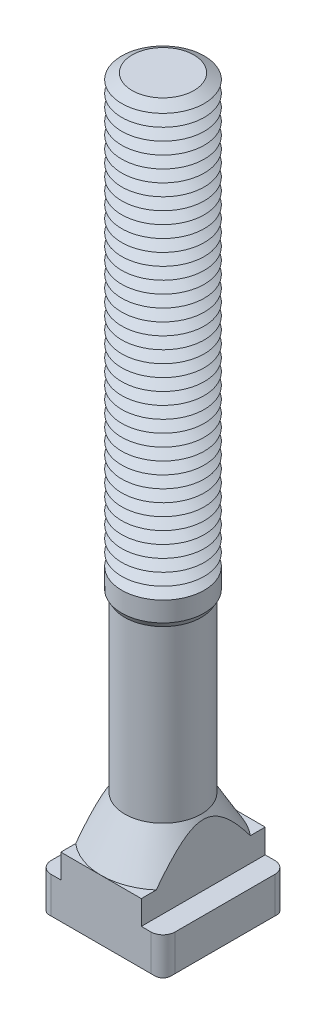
ISO-10303-21;
HEADER;
FILE_DESCRIPTION(('STEP AP214'),'2;1');
FILE_NAME('part.step','',(''),(''),'','','');
FILE_SCHEMA(('AUTOMOTIVE_DESIGN { 1 0 10303 214 1 1 1 1 }'));
ENDSEC;
DATA;
#1=APPLICATION_CONTEXT('core data for automotive mechanical design processes');
#2=APPLICATION_PROTOCOL_DEFINITION('international standard','automotive_design',2000,#1);
#3=PRODUCT_CONTEXT('',#1,'mechanical');
#4=PRODUCT('Part','Part','',(#3));
#5=PRODUCT_RELATED_PRODUCT_CATEGORY('part','',(#4));
#6=PRODUCT_DEFINITION_FORMATION('','',#4);
#7=PRODUCT_DEFINITION_CONTEXT('part definition',#1,'design');
#8=PRODUCT_DEFINITION('design','',#6,#7);
#9=PRODUCT_DEFINITION_SHAPE('','',#8);
#10=(LENGTH_UNIT() NAMED_UNIT(*) SI_UNIT(.MILLI.,.METRE.));
#11=(NAMED_UNIT(*) PLANE_ANGLE_UNIT() SI_UNIT($,.RADIAN.));
#12=(NAMED_UNIT(*) SI_UNIT($,.STERADIAN.) SOLID_ANGLE_UNIT());
#13=UNCERTAINTY_MEASURE_WITH_UNIT(LENGTH_MEASURE(1.E-05),#10,'distance_accuracy_value','');
#14=(GEOMETRIC_REPRESENTATION_CONTEXT(3) GLOBAL_UNCERTAINTY_ASSIGNED_CONTEXT((#13)) GLOBAL_UNIT_ASSIGNED_CONTEXT((#10,
#11,#12)) REPRESENTATION_CONTEXT('',''));
#15=CARTESIAN_POINT('',(0.,0.,0.));
#16=DIRECTION('',(0.,0.,1.));
#17=DIRECTION('',(1.,0.,0.));
#18=AXIS2_PLACEMENT_3D('',#15,#16,#17);
#19=CARTESIAN_POINT('',(0.,100.,0.));
#20=DIRECTION('',(0.,-1.,0.));
#21=DIRECTION('',(0.,0.,-1.));
#22=AXIS2_PLACEMENT_3D('',#19,#20,#21);
#23=CONICAL_SURFACE('',#22,4.48445554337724,1.0471975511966);
#24=CARTESIAN_POINT('',(0.,99.125,0.));
#25=DIRECTION('',(0.,-1.,0.));
#26=DIRECTION('',(0.,0.,-1.));
#27=AXIS2_PLACEMENT_3D('',#24,#25,#26);
#28=CIRCLE('',#27,6.00000000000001);
#29=CARTESIAN_POINT('',(0.,99.125,-6.00000000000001));
#30=VERTEX_POINT('',#29);
#31=EDGE_CURVE('E688',#30,#30,#28,.T.);
#32=ORIENTED_EDGE('',*,*,#31,.F.);
#33=EDGE_LOOP('',(#32));
#34=FACE_BOUND('',#33,.T.);
#35=CARTESIAN_POINT('',(0.,100.,0.));
#36=DIRECTION('',(0.,-1.,0.));
#37=DIRECTION('',(0.,0.,-1.));
#38=AXIS2_PLACEMENT_3D('',#35,#36,#37);
#39=CIRCLE('',#38,4.48445554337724);
#40=CARTESIAN_POINT('',(0.,100.,-4.48445554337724));
#41=VERTEX_POINT('',#40);
#42=EDGE_CURVE('E695',#41,#41,#39,.T.);
#43=ORIENTED_EDGE('',*,*,#42,.T.);
#44=EDGE_LOOP('',(#43));
#45=FACE_BOUND('',#44,.T.);
#46=ADVANCED_FACE('F39',(#34,#45),#23,.T.);
#47=CARTESIAN_POINT('',(0.,100.875,0.));
#48=DIRECTION('',(0.,1.,0.));
#49=DIRECTION('',(0.,0.,1.));
#50=AXIS2_PLACEMENT_3D('',#47,#48,#49);
#51=CONICAL_SURFACE('',#50,6.00000000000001,1.0471975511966);
#52=ORIENTED_EDGE('',*,*,#42,.F.);
#53=EDGE_LOOP('',(#52));
#54=FACE_BOUND('',#53,.T.);
#55=CARTESIAN_POINT('',(0.,100.875,0.));
#56=DIRECTION('',(0.,-1.,0.));
#57=DIRECTION('',(0.,0.,-1.));
#58=AXIS2_PLACEMENT_3D('',#55,#56,#57);
#59=CIRCLE('',#58,6.00000000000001);
#60=CARTESIAN_POINT('',(0.,100.875,-6.00000000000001));
#61=VERTEX_POINT('',#60);
#62=EDGE_CURVE('E667',#61,#61,#59,.T.);
#63=ORIENTED_EDGE('',*,*,#62,.T.);
#64=EDGE_LOOP('',(#63));
#65=FACE_BOUND('',#64,.T.);
#66=ADVANCED_FACE('F449',(#54,#65),#51,.T.);
#67=CARTESIAN_POINT('',(2.99969591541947,107.,0.));
#68=DIRECTION('',(0.,-1.,0.));
#69=DIRECTION('',(1.,0.,0.));
#70=AXIS2_PLACEMENT_3D('',#67,#68,#69);
#71=PLANE('',#70);
#72=CARTESIAN_POINT('',(0.,107.,0.));
#73=DIRECTION('',(0.,-1.,0.));
#74=DIRECTION('',(0.,0.,-1.));
#75=AXIS2_PLACEMENT_3D('',#72,#73,#74);
#76=CIRCLE('',#75,4.48445554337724);
#77=CARTESIAN_POINT('',(0.,107.,-4.48445554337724));
#78=VERTEX_POINT('',#77);
#79=EDGE_CURVE('E726',#78,#78,#76,.T.);
#80=ORIENTED_EDGE('',*,*,#79,.F.);
#81=EDGE_LOOP('',(#80));
#82=FACE_BOUND('',#81,.T.);
#83=ADVANCED_FACE('F455',(#82),#71,.F.);
#84=CARTESIAN_POINT('',(0.,107.,0.));
#85=DIRECTION('',(0.,-1.,0.));
#86=DIRECTION('',(0.,0.,-1.));
#87=AXIS2_PLACEMENT_3D('',#84,#85,#86);
#88=CONICAL_SURFACE('',#87,4.48445554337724,1.0471975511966);
#89=CARTESIAN_POINT('',(0.,106.125,0.));
#90=DIRECTION('',(0.,-1.,0.));
#91=DIRECTION('',(0.,0.,-1.));
#92=AXIS2_PLACEMENT_3D('',#89,#90,#91);
#93=CIRCLE('',#92,6.00000000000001);
#94=CARTESIAN_POINT('',(0.,106.125,-6.00000000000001));
#95=VERTEX_POINT('',#94);
#96=EDGE_CURVE('E722',#95,#95,#93,.T.);
#97=ORIENTED_EDGE('',*,*,#96,.F.);
#98=EDGE_LOOP('',(#97));
#99=FACE_BOUND('',#98,.T.);
#100=ORIENTED_EDGE('',*,*,#79,.T.);
#101=EDGE_LOOP('',(#100));
#102=FACE_BOUND('',#101,.T.);
#103=ADVANCED_FACE('F483',(#99,#102),#88,.T.);
#104=CARTESIAN_POINT('',(0.,106.125,0.));
#105=DIRECTION('',(0.,1.,0.));
#106=DIRECTION('',(0.,0.,1.));
#107=AXIS2_PLACEMENT_3D('',#104,#105,#106);
#108=CONICAL_SURFACE('',#107,6.00000000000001,1.0471975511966);
#109=CARTESIAN_POINT('',(0.,105.25,0.));
#110=DIRECTION('',(0.,-1.,0.));
#111=DIRECTION('',(0.,0.,-1.));
#112=AXIS2_PLACEMENT_3D('',#109,#110,#111);
#113=CIRCLE('',#112,4.48445554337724);
#114=CARTESIAN_POINT('',(0.,105.25,-4.48445554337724));
#115=VERTEX_POINT('',#114);
#116=EDGE_CURVE('E718',#115,#115,#113,.T.);
#117=ORIENTED_EDGE('',*,*,#116,.F.);
#118=EDGE_LOOP('',(#117));
#119=FACE_BOUND('',#118,.T.);
#120=ORIENTED_EDGE('',*,*,#96,.T.);
#121=EDGE_LOOP('',(#120));
#122=FACE_BOUND('',#121,.T.);
#123=ADVANCED_FACE('F480',(#119,#122),#108,.T.);
#124=CARTESIAN_POINT('',(0.,105.25,0.));
#125=DIRECTION('',(0.,-1.,0.));
#126=DIRECTION('',(0.,0.,-1.));
#127=AXIS2_PLACEMENT_3D('',#124,#125,#126);
#128=CONICAL_SURFACE('',#127,4.48445554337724,1.0471975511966);
#129=CARTESIAN_POINT('',(0.,104.375,0.));
#130=DIRECTION('',(0.,-1.,0.));
#131=DIRECTION('',(0.,0.,-1.));
#132=AXIS2_PLACEMENT_3D('',#129,#130,#131);
#133=CIRCLE('',#132,6.00000000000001);
#134=CARTESIAN_POINT('',(0.,104.375,-6.00000000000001));
#135=VERTEX_POINT('',#134);
#136=EDGE_CURVE('E714',#135,#135,#133,.T.);
#137=ORIENTED_EDGE('',*,*,#136,.F.);
#138=EDGE_LOOP('',(#137));
#139=FACE_BOUND('',#138,.T.);
#140=ORIENTED_EDGE('',*,*,#116,.T.);
#141=EDGE_LOOP('',(#140));
#142=FACE_BOUND('',#141,.T.);
#143=ADVANCED_FACE('F475',(#139,#142),#128,.T.);
#144=CARTESIAN_POINT('',(0.,104.375,0.));
#145=DIRECTION('',(0.,1.,0.));
#146=DIRECTION('',(0.,0.,1.));
#147=AXIS2_PLACEMENT_3D('',#144,#145,#146);
#148=CONICAL_SURFACE('',#147,6.00000000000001,1.0471975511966);
#149=CARTESIAN_POINT('',(0.,103.5,0.));
#150=DIRECTION('',(0.,-1.,0.));
#151=DIRECTION('',(0.,0.,-1.));
#152=AXIS2_PLACEMENT_3D('',#149,#150,#151);
#153=CIRCLE('',#152,4.48445554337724);
#154=CARTESIAN_POINT('',(0.,103.5,-4.48445554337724));
#155=VERTEX_POINT('',#154);
#156=EDGE_CURVE('E710',#155,#155,#153,.T.);
#157=ORIENTED_EDGE('',*,*,#156,.F.);
#158=EDGE_LOOP('',(#157));
#159=FACE_BOUND('',#158,.T.);
#160=ORIENTED_EDGE('',*,*,#136,.T.);
#161=EDGE_LOOP('',(#160));
#162=FACE_BOUND('',#161,.T.);
#163=ADVANCED_FACE('F472',(#159,#162),#148,.T.);
#164=CARTESIAN_POINT('',(0.,103.5,0.));
#165=DIRECTION('',(0.,-1.,0.));
#166=DIRECTION('',(0.,0.,-1.));
#167=AXIS2_PLACEMENT_3D('',#164,#165,#166);
#168=CONICAL_SURFACE('',#167,4.48445554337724,1.0471975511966);
#169=CARTESIAN_POINT('',(0.,102.625,0.));
#170=DIRECTION('',(0.,-1.,0.));
#171=DIRECTION('',(0.,0.,-1.));
#172=AXIS2_PLACEMENT_3D('',#169,#170,#171);
#173=CIRCLE('',#172,6.00000000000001);
#174=CARTESIAN_POINT('',(0.,102.625,-6.00000000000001));
#175=VERTEX_POINT('',#174);
#176=EDGE_CURVE('E666',#175,#175,#173,.T.);
#177=ORIENTED_EDGE('',*,*,#176,.F.);
#178=EDGE_LOOP('',(#177));
#179=FACE_BOUND('',#178,.T.);
#180=ORIENTED_EDGE('',*,*,#156,.T.);
#181=EDGE_LOOP('',(#180));
#182=FACE_BOUND('',#181,.T.);
#183=ADVANCED_FACE('F466',(#179,#182),#168,.T.);
#184=CARTESIAN_POINT('',(0.,102.625,0.));
#185=DIRECTION('',(0.,1.,0.));
#186=DIRECTION('',(0.,0.,1.));
#187=AXIS2_PLACEMENT_3D('',#184,#185,#186);
#188=CONICAL_SURFACE('',#187,6.00000000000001,1.0471975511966);
#189=CARTESIAN_POINT('',(0.,101.75,0.));
#190=DIRECTION('',(0.,-1.,0.));
#191=DIRECTION('',(0.,0.,-1.));
#192=AXIS2_PLACEMENT_3D('',#189,#190,#191);
#193=CIRCLE('',#192,4.48445554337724);
#194=CARTESIAN_POINT('',(0.,101.75,-4.48445554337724));
#195=VERTEX_POINT('',#194);
#196=EDGE_CURVE('E664',#195,#195,#193,.T.);
#197=ORIENTED_EDGE('',*,*,#196,.F.);
#198=EDGE_LOOP('',(#197));
#199=FACE_BOUND('',#198,.T.);
#200=ORIENTED_EDGE('',*,*,#176,.T.);
#201=EDGE_LOOP('',(#200));
#202=FACE_BOUND('',#201,.T.);
#203=ADVANCED_FACE('F462',(#199,#202),#188,.T.);
#204=CARTESIAN_POINT('',(0.,101.75,0.));
#205=DIRECTION('',(0.,-1.,0.));
#206=DIRECTION('',(0.,0.,-1.));
#207=AXIS2_PLACEMENT_3D('',#204,#205,#206);
#208=CONICAL_SURFACE('',#207,4.48445554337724,1.0471975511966);
#209=ORIENTED_EDGE('',*,*,#62,.F.);
#210=EDGE_LOOP('',(#209));
#211=FACE_BOUND('',#210,.T.);
#212=ORIENTED_EDGE('',*,*,#196,.T.);
#213=EDGE_LOOP('',(#212));
#214=FACE_BOUND('',#213,.T.);
#215=ADVANCED_FACE('F465',(#211,#214),#208,.T.);
#216=CARTESIAN_POINT('',(0.,98.25,0.));
#217=DIRECTION('',(0.,-1.,0.));
#218=DIRECTION('',(0.,0.,-1.));
#219=AXIS2_PLACEMENT_3D('',#216,#217,#218);
#220=CONICAL_SURFACE('',#219,4.48445554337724,1.0471975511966);
#221=CARTESIAN_POINT('',(0.,97.375,0.));
#222=DIRECTION('',(0.,-1.,0.));
#223=DIRECTION('',(0.,0.,-1.));
#224=AXIS2_PLACEMENT_3D('',#221,#222,#223);
#225=CIRCLE('',#224,6.00000000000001);
#226=CARTESIAN_POINT('',(0.,97.375,-6.00000000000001));
#227=VERTEX_POINT('',#226);
#228=EDGE_CURVE('E689',#227,#227,#225,.T.);
#229=ORIENTED_EDGE('',*,*,#228,.F.);
#230=EDGE_LOOP('',(#229));
#231=FACE_BOUND('',#230,.T.);
#232=CARTESIAN_POINT('',(0.,98.25,0.));
#233=DIRECTION('',(0.,-1.,0.));
#234=DIRECTION('',(0.,0.,-1.));
#235=AXIS2_PLACEMENT_3D('',#232,#233,#234);
#236=CIRCLE('',#235,4.48445554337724);
#237=CARTESIAN_POINT('',(0.,98.25,-4.48445554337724));
#238=VERTEX_POINT('',#237);
#239=EDGE_CURVE('E686',#238,#238,#236,.T.);
#240=ORIENTED_EDGE('',*,*,#239,.T.);
#241=EDGE_LOOP('',(#240));
#242=FACE_BOUND('',#241,.T.);
#243=ADVANCED_FACE('F470',(#231,#242),#220,.T.);
#244=CARTESIAN_POINT('',(0.,99.125,0.));
#245=DIRECTION('',(0.,1.,0.));
#246=DIRECTION('',(0.,0.,1.));
#247=AXIS2_PLACEMENT_3D('',#244,#245,#246);
#248=CONICAL_SURFACE('',#247,6.00000000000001,1.0471975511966);
#249=ORIENTED_EDGE('',*,*,#239,.F.);
#250=EDGE_LOOP('',(#249));
#251=FACE_BOUND('',#250,.T.);
#252=ORIENTED_EDGE('',*,*,#31,.T.);
#253=EDGE_LOOP('',(#252));
#254=FACE_BOUND('',#253,.T.);
#255=ADVANCED_FACE('F786',(#251,#254),#248,.T.);
#256=CARTESIAN_POINT('',(0.,96.5,0.));
#257=DIRECTION('',(0.,-1.,0.));
#258=DIRECTION('',(0.,0.,-1.));
#259=AXIS2_PLACEMENT_3D('',#256,#257,#258);
#260=CONICAL_SURFACE('',#259,4.48445554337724,1.0471975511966);
#261=CARTESIAN_POINT('',(0.,95.625,0.));
#262=DIRECTION('',(0.,-1.,0.));
#263=DIRECTION('',(0.,0.,-1.));
#264=AXIS2_PLACEMENT_3D('',#261,#262,#263);
#265=CIRCLE('',#264,6.00000000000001);
#266=CARTESIAN_POINT('',(0.,95.625,-6.00000000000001));
#267=VERTEX_POINT('',#266);
#268=EDGE_CURVE('E758',#267,#267,#265,.T.);
#269=ORIENTED_EDGE('',*,*,#268,.F.);
#270=EDGE_LOOP('',(#269));
#271=FACE_BOUND('',#270,.T.);
#272=CARTESIAN_POINT('',(0.,96.5,0.));
#273=DIRECTION('',(0.,-1.,0.));
#274=DIRECTION('',(0.,0.,-1.));
#275=AXIS2_PLACEMENT_3D('',#272,#273,#274);
#276=CIRCLE('',#275,4.48445554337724);
#277=CARTESIAN_POINT('',(0.,96.5,-4.48445554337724));
#278=VERTEX_POINT('',#277);
#279=EDGE_CURVE('E699',#278,#278,#276,.T.);
#280=ORIENTED_EDGE('',*,*,#279,.T.);
#281=EDGE_LOOP('',(#280));
#282=FACE_BOUND('',#281,.T.);
#283=ADVANCED_FACE('F776',(#271,#282),#260,.T.);
#284=CARTESIAN_POINT('',(0.,97.375,0.));
#285=DIRECTION('',(0.,1.,0.));
#286=DIRECTION('',(0.,0.,1.));
#287=AXIS2_PLACEMENT_3D('',#284,#285,#286);
#288=CONICAL_SURFACE('',#287,6.00000000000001,1.0471975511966);
#289=ORIENTED_EDGE('',*,*,#279,.F.);
#290=EDGE_LOOP('',(#289));
#291=FACE_BOUND('',#290,.T.);
#292=ORIENTED_EDGE('',*,*,#228,.T.);
#293=EDGE_LOOP('',(#292));
#294=FACE_BOUND('',#293,.T.);
#295=ADVANCED_FACE('F778',(#291,#294),#288,.T.);
#296=CARTESIAN_POINT('',(0.,94.75,0.));
#297=DIRECTION('',(0.,-1.,0.));
#298=DIRECTION('',(0.,0.,-1.));
#299=AXIS2_PLACEMENT_3D('',#296,#297,#298);
#300=CONICAL_SURFACE('',#299,4.48445554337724,1.0471975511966);
#301=CARTESIAN_POINT('',(0.,93.875,0.));
#302=DIRECTION('',(0.,-1.,0.));
#303=DIRECTION('',(0.,0.,-1.));
#304=AXIS2_PLACEMENT_3D('',#301,#302,#303);
#305=CIRCLE('',#304,6.00000000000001);
#306=CARTESIAN_POINT('',(0.,93.875,-6.00000000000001));
#307=VERTEX_POINT('',#306);
#308=EDGE_CURVE('E759',#307,#307,#305,.T.);
#309=ORIENTED_EDGE('',*,*,#308,.F.);
#310=EDGE_LOOP('',(#309));
#311=FACE_BOUND('',#310,.T.);
#312=CARTESIAN_POINT('',(0.,94.75,0.));
#313=DIRECTION('',(0.,-1.,0.));
#314=DIRECTION('',(0.,0.,-1.));
#315=AXIS2_PLACEMENT_3D('',#312,#313,#314);
#316=CIRCLE('',#315,4.48445554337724);
#317=CARTESIAN_POINT('',(0.,94.75,-4.48445554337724));
#318=VERTEX_POINT('',#317);
#319=EDGE_CURVE('E756',#318,#318,#316,.T.);
#320=ORIENTED_EDGE('',*,*,#319,.T.);
#321=EDGE_LOOP('',(#320));
#322=FACE_BOUND('',#321,.T.);
#323=ADVANCED_FACE('F781',(#311,#322),#300,.T.);
#324=CARTESIAN_POINT('',(0.,95.625,0.));
#325=DIRECTION('',(0.,1.,0.));
#326=DIRECTION('',(0.,0.,1.));
#327=AXIS2_PLACEMENT_3D('',#324,#325,#326);
#328=CONICAL_SURFACE('',#327,6.00000000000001,1.0471975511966);
#329=ORIENTED_EDGE('',*,*,#319,.F.);
#330=EDGE_LOOP('',(#329));
#331=FACE_BOUND('',#330,.T.);
#332=ORIENTED_EDGE('',*,*,#268,.T.);
#333=EDGE_LOOP('',(#332));
#334=FACE_BOUND('',#333,.T.);
#335=ADVANCED_FACE('F798',(#331,#334),#328,.T.);
#336=CARTESIAN_POINT('',(0.,93.,0.));
#337=DIRECTION('',(0.,-1.,0.));
#338=DIRECTION('',(0.,0.,-1.));
#339=AXIS2_PLACEMENT_3D('',#336,#337,#338);
#340=CONICAL_SURFACE('',#339,4.48445554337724,1.0471975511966);
#341=CARTESIAN_POINT('',(0.,92.125,0.));
#342=DIRECTION('',(0.,-1.,0.));
#343=DIRECTION('',(0.,0.,-1.));
#344=AXIS2_PLACEMENT_3D('',#341,#342,#343);
#345=CIRCLE('',#344,6.00000000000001);
#346=CARTESIAN_POINT('',(0.,92.125,-6.00000000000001));
#347=VERTEX_POINT('',#346);
#348=EDGE_CURVE('E661',#347,#347,#345,.T.);
#349=ORIENTED_EDGE('',*,*,#348,.F.);
#350=EDGE_LOOP('',(#349));
#351=FACE_BOUND('',#350,.T.);
#352=CARTESIAN_POINT('',(0.,93.,0.));
#353=DIRECTION('',(0.,-1.,0.));
#354=DIRECTION('',(0.,0.,-1.));
#355=AXIS2_PLACEMENT_3D('',#352,#353,#354);
#356=CIRCLE('',#355,4.48445554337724);
#357=CARTESIAN_POINT('',(0.,93.,-4.48445554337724));
#358=VERTEX_POINT('',#357);
#359=EDGE_CURVE('E768',#358,#358,#356,.T.);
#360=ORIENTED_EDGE('',*,*,#359,.T.);
#361=EDGE_LOOP('',(#360));
#362=FACE_BOUND('',#361,.T.);
#363=ADVANCED_FACE('F802',(#351,#362),#340,.T.);
#364=CARTESIAN_POINT('',(0.,93.875,0.));
#365=DIRECTION('',(0.,1.,0.));
#366=DIRECTION('',(0.,0.,1.));
#367=AXIS2_PLACEMENT_3D('',#364,#365,#366);
#368=CONICAL_SURFACE('',#367,6.00000000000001,1.0471975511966);
#369=ORIENTED_EDGE('',*,*,#359,.F.);
#370=EDGE_LOOP('',(#369));
#371=FACE_BOUND('',#370,.T.);
#372=ORIENTED_EDGE('',*,*,#308,.T.);
#373=EDGE_LOOP('',(#372));
#374=FACE_BOUND('',#373,.T.);
#375=ADVANCED_FACE('F806',(#371,#374),#368,.T.);
#376=CARTESIAN_POINT('',(0.,91.25,0.));
#377=DIRECTION('',(0.,-1.,0.));
#378=DIRECTION('',(0.,0.,-1.));
#379=AXIS2_PLACEMENT_3D('',#376,#377,#378);
#380=CONICAL_SURFACE('',#379,4.48445554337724,1.0471975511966);
#381=CARTESIAN_POINT('',(0.,90.375,0.));
#382=DIRECTION('',(0.,-1.,0.));
#383=DIRECTION('',(0.,0.,-1.));
#384=AXIS2_PLACEMENT_3D('',#381,#382,#383);
#385=CIRCLE('',#384,6.00000000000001);
#386=CARTESIAN_POINT('',(0.,90.375,-6.00000000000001));
#387=VERTEX_POINT('',#386);
#388=EDGE_CURVE('E662',#387,#387,#385,.T.);
#389=ORIENTED_EDGE('',*,*,#388,.F.);
#390=EDGE_LOOP('',(#389));
#391=FACE_BOUND('',#390,.T.);
#392=CARTESIAN_POINT('',(0.,91.25,0.));
#393=DIRECTION('',(0.,-1.,0.));
#394=DIRECTION('',(0.,0.,-1.));
#395=AXIS2_PLACEMENT_3D('',#392,#393,#394);
#396=CIRCLE('',#395,4.48445554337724);
#397=CARTESIAN_POINT('',(0.,91.25,-4.48445554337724));
#398=VERTEX_POINT('',#397);
#399=EDGE_CURVE('E658',#398,#398,#396,.T.);
#400=ORIENTED_EDGE('',*,*,#399,.T.);
#401=EDGE_LOOP('',(#400));
#402=FACE_BOUND('',#401,.T.);
#403=ADVANCED_FACE('F810',(#391,#402),#380,.T.);
#404=CARTESIAN_POINT('',(0.,92.125,0.));
#405=DIRECTION('',(0.,1.,0.));
#406=DIRECTION('',(0.,0.,1.));
#407=AXIS2_PLACEMENT_3D('',#404,#405,#406);
#408=CONICAL_SURFACE('',#407,6.00000000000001,1.0471975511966);
#409=ORIENTED_EDGE('',*,*,#399,.F.);
#410=EDGE_LOOP('',(#409));
#411=FACE_BOUND('',#410,.T.);
#412=ORIENTED_EDGE('',*,*,#348,.T.);
#413=EDGE_LOOP('',(#412));
#414=FACE_BOUND('',#413,.T.);
#415=ADVANCED_FACE('F814',(#411,#414),#408,.T.);
#416=CARTESIAN_POINT('',(0.,89.5,0.));
#417=DIRECTION('',(0.,-1.,0.));
#418=DIRECTION('',(0.,0.,-1.));
#419=AXIS2_PLACEMENT_3D('',#416,#417,#418);
#420=CONICAL_SURFACE('',#419,4.48445554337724,1.0471975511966);
#421=CARTESIAN_POINT('',(0.,88.625,0.));
#422=DIRECTION('',(0.,-1.,0.));
#423=DIRECTION('',(0.,0.,-1.));
#424=AXIS2_PLACEMENT_3D('',#421,#422,#423);
#425=CIRCLE('',#424,6.00000000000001);
#426=CARTESIAN_POINT('',(0.,88.625,-6.00000000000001));
#427=VERTEX_POINT('',#426);
#428=EDGE_CURVE('E681',#427,#427,#425,.T.);
#429=ORIENTED_EDGE('',*,*,#428,.F.);
#430=EDGE_LOOP('',(#429));
#431=FACE_BOUND('',#430,.T.);
#432=CARTESIAN_POINT('',(0.,89.5,0.));
#433=DIRECTION('',(0.,-1.,0.));
#434=DIRECTION('',(0.,0.,-1.));
#435=AXIS2_PLACEMENT_3D('',#432,#433,#434);
#436=CIRCLE('',#435,4.48445554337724);
#437=CARTESIAN_POINT('',(0.,89.5,-4.48445554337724));
#438=VERTEX_POINT('',#437);
#439=EDGE_CURVE('E683',#438,#438,#436,.T.);
#440=ORIENTED_EDGE('',*,*,#439,.T.);
#441=EDGE_LOOP('',(#440));
#442=FACE_BOUND('',#441,.T.);
#443=ADVANCED_FACE('F818',(#431,#442),#420,.T.);
#444=CARTESIAN_POINT('',(0.,90.375,0.));
#445=DIRECTION('',(0.,1.,0.));
#446=DIRECTION('',(0.,0.,1.));
#447=AXIS2_PLACEMENT_3D('',#444,#445,#446);
#448=CONICAL_SURFACE('',#447,6.00000000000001,1.0471975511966);
#449=ORIENTED_EDGE('',*,*,#439,.F.);
#450=EDGE_LOOP('',(#449));
#451=FACE_BOUND('',#450,.T.);
#452=ORIENTED_EDGE('',*,*,#388,.T.);
#453=EDGE_LOOP('',(#452));
#454=FACE_BOUND('',#453,.T.);
#455=ADVANCED_FACE('F822',(#451,#454),#448,.T.);
#456=CARTESIAN_POINT('',(0.,87.75,0.));
#457=DIRECTION('',(0.,-1.,0.));
#458=DIRECTION('',(0.,0.,-1.));
#459=AXIS2_PLACEMENT_3D('',#456,#457,#458);
#460=CONICAL_SURFACE('',#459,4.48445554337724,1.0471975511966);
#461=CARTESIAN_POINT('',(0.,86.875,0.));
#462=DIRECTION('',(0.,-1.,0.));
#463=DIRECTION('',(0.,0.,-1.));
#464=AXIS2_PLACEMENT_3D('',#461,#462,#463);
#465=CIRCLE('',#464,6.00000000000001);
#466=CARTESIAN_POINT('',(0.,86.875,-6.00000000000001));
#467=VERTEX_POINT('',#466);
#468=EDGE_CURVE('E1168',#467,#467,#465,.T.);
#469=ORIENTED_EDGE('',*,*,#468,.F.);
#470=EDGE_LOOP('',(#469));
#471=FACE_BOUND('',#470,.T.);
#472=CARTESIAN_POINT('',(0.,87.75,0.));
#473=DIRECTION('',(0.,-1.,0.));
#474=DIRECTION('',(0.,0.,-1.));
#475=AXIS2_PLACEMENT_3D('',#472,#473,#474);
#476=CIRCLE('',#475,4.48445554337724);
#477=CARTESIAN_POINT('',(0.,87.75,-4.48445554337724));
#478=VERTEX_POINT('',#477);
#479=EDGE_CURVE('E684',#478,#478,#476,.T.);
#480=ORIENTED_EDGE('',*,*,#479,.T.);
#481=EDGE_LOOP('',(#480));
#482=FACE_BOUND('',#481,.T.);
#483=ADVANCED_FACE('F826',(#471,#482),#460,.T.);
#484=CARTESIAN_POINT('',(0.,88.625,0.));
#485=DIRECTION('',(0.,1.,0.));
#486=DIRECTION('',(0.,0.,1.));
#487=AXIS2_PLACEMENT_3D('',#484,#485,#486);
#488=CONICAL_SURFACE('',#487,6.00000000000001,1.0471975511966);
#489=ORIENTED_EDGE('',*,*,#479,.F.);
#490=EDGE_LOOP('',(#489));
#491=FACE_BOUND('',#490,.T.);
#492=ORIENTED_EDGE('',*,*,#428,.T.);
#493=EDGE_LOOP('',(#492));
#494=FACE_BOUND('',#493,.T.);
#495=ADVANCED_FACE('F830',(#491,#494),#488,.T.);
#496=CARTESIAN_POINT('',(0.,86.,0.));
#497=DIRECTION('',(0.,-1.,0.));
#498=DIRECTION('',(0.,0.,-1.));
#499=AXIS2_PLACEMENT_3D('',#496,#497,#498);
#500=CONICAL_SURFACE('',#499,4.48445554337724,1.0471975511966);
#501=CARTESIAN_POINT('',(0.,85.125,0.));
#502=DIRECTION('',(0.,-1.,0.));
#503=DIRECTION('',(0.,0.,-1.));
#504=AXIS2_PLACEMENT_3D('',#501,#502,#503);
#505=CIRCLE('',#504,6.00000000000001);
#506=CARTESIAN_POINT('',(0.,85.125,-6.00000000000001));
#507=VERTEX_POINT('',#506);
#508=EDGE_CURVE('E1160',#507,#507,#505,.T.);
#509=ORIENTED_EDGE('',*,*,#508,.F.);
#510=EDGE_LOOP('',(#509));
#511=FACE_BOUND('',#510,.T.);
#512=CARTESIAN_POINT('',(0.,86.,0.));
#513=DIRECTION('',(0.,-1.,0.));
#514=DIRECTION('',(0.,0.,-1.));
#515=AXIS2_PLACEMENT_3D('',#512,#513,#514);
#516=CIRCLE('',#515,4.48445554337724);
#517=CARTESIAN_POINT('',(0.,86.,-4.48445554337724));
#518=VERTEX_POINT('',#517);
#519=EDGE_CURVE('E1164',#518,#518,#516,.T.);
#520=ORIENTED_EDGE('',*,*,#519,.T.);
#521=EDGE_LOOP('',(#520));
#522=FACE_BOUND('',#521,.T.);
#523=ADVANCED_FACE('F834',(#511,#522),#500,.T.);
#524=CARTESIAN_POINT('',(0.,86.875,0.));
#525=DIRECTION('',(0.,1.,0.));
#526=DIRECTION('',(0.,0.,1.));
#527=AXIS2_PLACEMENT_3D('',#524,#525,#526);
#528=CONICAL_SURFACE('',#527,6.00000000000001,1.0471975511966);
#529=ORIENTED_EDGE('',*,*,#519,.F.);
#530=EDGE_LOOP('',(#529));
#531=FACE_BOUND('',#530,.T.);
#532=ORIENTED_EDGE('',*,*,#468,.T.);
#533=EDGE_LOOP('',(#532));
#534=FACE_BOUND('',#533,.T.);
#535=ADVANCED_FACE('F838',(#531,#534),#528,.T.);
#536=CARTESIAN_POINT('',(0.,84.25,0.));
#537=DIRECTION('',(0.,-1.,0.));
#538=DIRECTION('',(0.,0.,-1.));
#539=AXIS2_PLACEMENT_3D('',#536,#537,#538);
#540=CONICAL_SURFACE('',#539,4.48445554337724,1.0471975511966);
#541=CARTESIAN_POINT('',(0.,83.375,0.));
#542=DIRECTION('',(0.,-1.,0.));
#543=DIRECTION('',(0.,0.,-1.));
#544=AXIS2_PLACEMENT_3D('',#541,#542,#543);
#545=CIRCLE('',#544,6.00000000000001);
#546=CARTESIAN_POINT('',(0.,83.375,-6.00000000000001));
#547=VERTEX_POINT('',#546);
#548=EDGE_CURVE('E1152',#547,#547,#545,.T.);
#549=ORIENTED_EDGE('',*,*,#548,.F.);
#550=EDGE_LOOP('',(#549));
#551=FACE_BOUND('',#550,.T.);
#552=CARTESIAN_POINT('',(0.,84.25,0.));
#553=DIRECTION('',(0.,-1.,0.));
#554=DIRECTION('',(0.,0.,-1.));
#555=AXIS2_PLACEMENT_3D('',#552,#553,#554);
#556=CIRCLE('',#555,4.48445554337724);
#557=CARTESIAN_POINT('',(0.,84.25,-4.48445554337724));
#558=VERTEX_POINT('',#557);
#559=EDGE_CURVE('E1156',#558,#558,#556,.T.);
#560=ORIENTED_EDGE('',*,*,#559,.T.);
#561=EDGE_LOOP('',(#560));
#562=FACE_BOUND('',#561,.T.);
#563=ADVANCED_FACE('F842',(#551,#562),#540,.T.);
#564=CARTESIAN_POINT('',(0.,85.125,0.));
#565=DIRECTION('',(0.,1.,0.));
#566=DIRECTION('',(0.,0.,1.));
#567=AXIS2_PLACEMENT_3D('',#564,#565,#566);
#568=CONICAL_SURFACE('',#567,6.00000000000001,1.0471975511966);
#569=ORIENTED_EDGE('',*,*,#559,.F.);
#570=EDGE_LOOP('',(#569));
#571=FACE_BOUND('',#570,.T.);
#572=ORIENTED_EDGE('',*,*,#508,.T.);
#573=EDGE_LOOP('',(#572));
#574=FACE_BOUND('',#573,.T.);
#575=ADVANCED_FACE('F846',(#571,#574),#568,.T.);
#576=CARTESIAN_POINT('',(0.,82.5,0.));
#577=DIRECTION('',(0.,-1.,0.));
#578=DIRECTION('',(0.,0.,-1.));
#579=AXIS2_PLACEMENT_3D('',#576,#577,#578);
#580=CONICAL_SURFACE('',#579,4.48445554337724,1.0471975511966);
#581=CARTESIAN_POINT('',(0.,81.625,0.));
#582=DIRECTION('',(0.,-1.,0.));
#583=DIRECTION('',(0.,0.,-1.));
#584=AXIS2_PLACEMENT_3D('',#581,#582,#583);
#585=CIRCLE('',#584,6.00000000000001);
#586=CARTESIAN_POINT('',(0.,81.625,-6.00000000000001));
#587=VERTEX_POINT('',#586);
#588=EDGE_CURVE('E1144',#587,#587,#585,.T.);
#589=ORIENTED_EDGE('',*,*,#588,.F.);
#590=EDGE_LOOP('',(#589));
#591=FACE_BOUND('',#590,.T.);
#592=CARTESIAN_POINT('',(0.,82.5,0.));
#593=DIRECTION('',(0.,-1.,0.));
#594=DIRECTION('',(0.,0.,-1.));
#595=AXIS2_PLACEMENT_3D('',#592,#593,#594);
#596=CIRCLE('',#595,4.48445554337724);
#597=CARTESIAN_POINT('',(0.,82.5,-4.48445554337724));
#598=VERTEX_POINT('',#597);
#599=EDGE_CURVE('E1148',#598,#598,#596,.T.);
#600=ORIENTED_EDGE('',*,*,#599,.T.);
#601=EDGE_LOOP('',(#600));
#602=FACE_BOUND('',#601,.T.);
#603=ADVANCED_FACE('F850',(#591,#602),#580,.T.);
#604=CARTESIAN_POINT('',(0.,83.375,0.));
#605=DIRECTION('',(0.,1.,0.));
#606=DIRECTION('',(0.,0.,1.));
#607=AXIS2_PLACEMENT_3D('',#604,#605,#606);
#608=CONICAL_SURFACE('',#607,6.00000000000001,1.0471975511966);
#609=ORIENTED_EDGE('',*,*,#599,.F.);
#610=EDGE_LOOP('',(#609));
#611=FACE_BOUND('',#610,.T.);
#612=ORIENTED_EDGE('',*,*,#548,.T.);
#613=EDGE_LOOP('',(#612));
#614=FACE_BOUND('',#613,.T.);
#615=ADVANCED_FACE('F854',(#611,#614),#608,.T.);
#616=CARTESIAN_POINT('',(0.,80.75,0.));
#617=DIRECTION('',(0.,-1.,0.));
#618=DIRECTION('',(0.,0.,-1.));
#619=AXIS2_PLACEMENT_3D('',#616,#617,#618);
#620=CONICAL_SURFACE('',#619,4.48445554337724,1.0471975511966);
#621=CARTESIAN_POINT('',(0.,79.875,0.));
#622=DIRECTION('',(0.,-1.,0.));
#623=DIRECTION('',(0.,0.,-1.));
#624=AXIS2_PLACEMENT_3D('',#621,#622,#623);
#625=CIRCLE('',#624,6.00000000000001);
#626=CARTESIAN_POINT('',(0.,79.875,-6.00000000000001));
#627=VERTEX_POINT('',#626);
#628=EDGE_CURVE('E655',#627,#627,#625,.T.);
#629=ORIENTED_EDGE('',*,*,#628,.F.);
#630=EDGE_LOOP('',(#629));
#631=FACE_BOUND('',#630,.T.);
#632=CARTESIAN_POINT('',(0.,80.75,0.));
#633=DIRECTION('',(0.,-1.,0.));
#634=DIRECTION('',(0.,0.,-1.));
#635=AXIS2_PLACEMENT_3D('',#632,#633,#634);
#636=CIRCLE('',#635,4.48445554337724);
#637=CARTESIAN_POINT('',(0.,80.75,-4.48445554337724));
#638=VERTEX_POINT('',#637);
#639=EDGE_CURVE('E1140',#638,#638,#636,.T.);
#640=ORIENTED_EDGE('',*,*,#639,.T.);
#641=EDGE_LOOP('',(#640));
#642=FACE_BOUND('',#641,.T.);
#643=ADVANCED_FACE('F858',(#631,#642),#620,.T.);
#644=CARTESIAN_POINT('',(0.,81.625,0.));
#645=DIRECTION('',(0.,1.,0.));
#646=DIRECTION('',(0.,0.,1.));
#647=AXIS2_PLACEMENT_3D('',#644,#645,#646);
#648=CONICAL_SURFACE('',#647,6.00000000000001,1.0471975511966);
#649=ORIENTED_EDGE('',*,*,#639,.F.);
#650=EDGE_LOOP('',(#649));
#651=FACE_BOUND('',#650,.T.);
#652=ORIENTED_EDGE('',*,*,#588,.T.);
#653=EDGE_LOOP('',(#652));
#654=FACE_BOUND('',#653,.T.);
#655=ADVANCED_FACE('F862',(#651,#654),#648,.T.);
#656=CARTESIAN_POINT('',(0.,79.,0.));
#657=DIRECTION('',(0.,-1.,0.));
#658=DIRECTION('',(0.,0.,-1.));
#659=AXIS2_PLACEMENT_3D('',#656,#657,#658);
#660=CONICAL_SURFACE('',#659,4.48445554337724,1.0471975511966);
#661=CARTESIAN_POINT('',(0.,78.125,0.));
#662=DIRECTION('',(0.,-1.,0.));
#663=DIRECTION('',(0.,0.,-1.));
#664=AXIS2_PLACEMENT_3D('',#661,#662,#663);
#665=CIRCLE('',#664,6.00000000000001);
#666=CARTESIAN_POINT('',(0.,78.125,-6.00000000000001));
#667=VERTEX_POINT('',#666);
#668=EDGE_CURVE('E656',#667,#667,#665,.T.);
#669=ORIENTED_EDGE('',*,*,#668,.F.);
#670=EDGE_LOOP('',(#669));
#671=FACE_BOUND('',#670,.T.);
#672=CARTESIAN_POINT('',(0.,79.,0.));
#673=DIRECTION('',(0.,-1.,0.));
#674=DIRECTION('',(0.,0.,-1.));
#675=AXIS2_PLACEMENT_3D('',#672,#673,#674);
#676=CIRCLE('',#675,4.48445554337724);
#677=CARTESIAN_POINT('',(0.,79.,-4.48445554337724));
#678=VERTEX_POINT('',#677);
#679=EDGE_CURVE('E652',#678,#678,#676,.T.);
#680=ORIENTED_EDGE('',*,*,#679,.T.);
#681=EDGE_LOOP('',(#680));
#682=FACE_BOUND('',#681,.T.);
#683=ADVANCED_FACE('F866',(#671,#682),#660,.T.);
#684=CARTESIAN_POINT('',(0.,79.875,0.));
#685=DIRECTION('',(0.,1.,0.));
#686=DIRECTION('',(0.,0.,1.));
#687=AXIS2_PLACEMENT_3D('',#684,#685,#686);
#688=CONICAL_SURFACE('',#687,6.00000000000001,1.0471975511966);
#689=ORIENTED_EDGE('',*,*,#679,.F.);
#690=EDGE_LOOP('',(#689));
#691=FACE_BOUND('',#690,.T.);
#692=ORIENTED_EDGE('',*,*,#628,.T.);
#693=EDGE_LOOP('',(#692));
#694=FACE_BOUND('',#693,.T.);
#695=ADVANCED_FACE('F870',(#691,#694),#688,.T.);
#696=CARTESIAN_POINT('',(0.,77.25,0.));
#697=DIRECTION('',(0.,-1.,0.));
#698=DIRECTION('',(0.,0.,-1.));
#699=AXIS2_PLACEMENT_3D('',#696,#697,#698);
#700=CONICAL_SURFACE('',#699,4.48445554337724,1.0471975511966);
#701=CARTESIAN_POINT('',(0.,76.375,0.));
#702=DIRECTION('',(0.,-1.,0.));
#703=DIRECTION('',(0.,0.,-1.));
#704=AXIS2_PLACEMENT_3D('',#701,#702,#703);
#705=CIRCLE('',#704,6.00000000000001);
#706=CARTESIAN_POINT('',(0.,76.375,-6.00000000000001));
#707=VERTEX_POINT('',#706);
#708=EDGE_CURVE('E1130',#707,#707,#705,.T.);
#709=ORIENTED_EDGE('',*,*,#708,.F.);
#710=EDGE_LOOP('',(#709));
#711=FACE_BOUND('',#710,.T.);
#712=CARTESIAN_POINT('',(0.,77.25,0.));
#713=DIRECTION('',(0.,-1.,0.));
#714=DIRECTION('',(0.,0.,-1.));
#715=AXIS2_PLACEMENT_3D('',#712,#713,#714);
#716=CIRCLE('',#715,4.48445554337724);
#717=CARTESIAN_POINT('',(0.,77.25,-4.48445554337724));
#718=VERTEX_POINT('',#717);
#719=EDGE_CURVE('E754',#718,#718,#716,.T.);
#720=ORIENTED_EDGE('',*,*,#719,.T.);
#721=EDGE_LOOP('',(#720));
#722=FACE_BOUND('',#721,.T.);
#723=ADVANCED_FACE('F874',(#711,#722),#700,.T.);
#724=CARTESIAN_POINT('',(0.,78.125,0.));
#725=DIRECTION('',(0.,1.,0.));
#726=DIRECTION('',(0.,0.,1.));
#727=AXIS2_PLACEMENT_3D('',#724,#725,#726);
#728=CONICAL_SURFACE('',#727,6.00000000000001,1.0471975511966);
#729=ORIENTED_EDGE('',*,*,#719,.F.);
#730=EDGE_LOOP('',(#729));
#731=FACE_BOUND('',#730,.T.);
#732=ORIENTED_EDGE('',*,*,#668,.T.);
#733=EDGE_LOOP('',(#732));
#734=FACE_BOUND('',#733,.T.);
#735=ADVANCED_FACE('F878',(#731,#734),#728,.T.);
#736=CARTESIAN_POINT('',(0.,75.5,0.));
#737=DIRECTION('',(0.,-1.,0.));
#738=DIRECTION('',(0.,0.,-1.));
#739=AXIS2_PLACEMENT_3D('',#736,#737,#738);
#740=CONICAL_SURFACE('',#739,4.48445554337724,1.0471975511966);
#741=CARTESIAN_POINT('',(0.,74.625,0.));
#742=DIRECTION('',(0.,-1.,0.));
#743=DIRECTION('',(0.,0.,-1.));
#744=AXIS2_PLACEMENT_3D('',#741,#742,#743);
#745=CIRCLE('',#744,6.00000000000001);
#746=CARTESIAN_POINT('',(0.,74.625,-6.00000000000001));
#747=VERTEX_POINT('',#746);
#748=EDGE_CURVE('E1123',#747,#747,#745,.T.);
#749=ORIENTED_EDGE('',*,*,#748,.F.);
#750=EDGE_LOOP('',(#749));
#751=FACE_BOUND('',#750,.T.);
#752=CARTESIAN_POINT('',(0.,75.5,0.));
#753=DIRECTION('',(0.,-1.,0.));
#754=DIRECTION('',(0.,0.,-1.));
#755=AXIS2_PLACEMENT_3D('',#752,#753,#754);
#756=CIRCLE('',#755,4.48445554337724);
#757=CARTESIAN_POINT('',(0.,75.5,-4.48445554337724));
#758=VERTEX_POINT('',#757);
#759=EDGE_CURVE('E1126',#758,#758,#756,.T.);
#760=ORIENTED_EDGE('',*,*,#759,.T.);
#761=EDGE_LOOP('',(#760));
#762=FACE_BOUND('',#761,.T.);
#763=ADVANCED_FACE('F882',(#751,#762),#740,.T.);
#764=CARTESIAN_POINT('',(0.,76.375,0.));
#765=DIRECTION('',(0.,1.,0.));
#766=DIRECTION('',(0.,0.,1.));
#767=AXIS2_PLACEMENT_3D('',#764,#765,#766);
#768=CONICAL_SURFACE('',#767,6.00000000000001,1.0471975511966);
#769=ORIENTED_EDGE('',*,*,#759,.F.);
#770=EDGE_LOOP('',(#769));
#771=FACE_BOUND('',#770,.T.);
#772=ORIENTED_EDGE('',*,*,#708,.T.);
#773=EDGE_LOOP('',(#772));
#774=FACE_BOUND('',#773,.T.);
#775=ADVANCED_FACE('F886',(#771,#774),#768,.T.);
#776=CARTESIAN_POINT('',(0.,73.75,0.));
#777=DIRECTION('',(0.,-1.,0.));
#778=DIRECTION('',(0.,0.,-1.));
#779=AXIS2_PLACEMENT_3D('',#776,#777,#778);
#780=CONICAL_SURFACE('',#779,4.48445554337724,1.0471975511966);
#781=CARTESIAN_POINT('',(0.,72.875,0.));
#782=DIRECTION('',(0.,-1.,0.));
#783=DIRECTION('',(0.,0.,-1.));
#784=AXIS2_PLACEMENT_3D('',#781,#782,#783);
#785=CIRCLE('',#784,6.00000000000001);
#786=CARTESIAN_POINT('',(0.,72.875,-6.00000000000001));
#787=VERTEX_POINT('',#786);
#788=EDGE_CURVE('E1115',#787,#787,#785,.T.);
#789=ORIENTED_EDGE('',*,*,#788,.F.);
#790=EDGE_LOOP('',(#789));
#791=FACE_BOUND('',#790,.T.);
#792=CARTESIAN_POINT('',(0.,73.75,0.));
#793=DIRECTION('',(0.,-1.,0.));
#794=DIRECTION('',(0.,0.,-1.));
#795=AXIS2_PLACEMENT_3D('',#792,#793,#794);
#796=CIRCLE('',#795,4.48445554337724);
#797=CARTESIAN_POINT('',(0.,73.75,-4.48445554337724));
#798=VERTEX_POINT('',#797);
#799=EDGE_CURVE('E1119',#798,#798,#796,.T.);
#800=ORIENTED_EDGE('',*,*,#799,.T.);
#801=EDGE_LOOP('',(#800));
#802=FACE_BOUND('',#801,.T.);
#803=ADVANCED_FACE('F890',(#791,#802),#780,.T.);
#804=CARTESIAN_POINT('',(0.,74.625,0.));
#805=DIRECTION('',(0.,1.,0.));
#806=DIRECTION('',(0.,0.,1.));
#807=AXIS2_PLACEMENT_3D('',#804,#805,#806);
#808=CONICAL_SURFACE('',#807,6.00000000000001,1.0471975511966);
#809=ORIENTED_EDGE('',*,*,#799,.F.);
#810=EDGE_LOOP('',(#809));
#811=FACE_BOUND('',#810,.T.);
#812=ORIENTED_EDGE('',*,*,#748,.T.);
#813=EDGE_LOOP('',(#812));
#814=FACE_BOUND('',#813,.T.);
#815=ADVANCED_FACE('F894',(#811,#814),#808,.T.);
#816=CARTESIAN_POINT('',(0.,72.,0.));
#817=DIRECTION('',(0.,-1.,0.));
#818=DIRECTION('',(0.,0.,-1.));
#819=AXIS2_PLACEMENT_3D('',#816,#817,#818);
#820=CONICAL_SURFACE('',#819,4.48445554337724,1.0471975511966);
#821=CARTESIAN_POINT('',(0.,71.125,0.));
#822=DIRECTION('',(0.,-1.,0.));
#823=DIRECTION('',(0.,0.,-1.));
#824=AXIS2_PLACEMENT_3D('',#821,#822,#823);
#825=CIRCLE('',#824,6.00000000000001);
#826=CARTESIAN_POINT('',(0.,71.125,-6.00000000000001));
#827=VERTEX_POINT('',#826);
#828=EDGE_CURVE('E1107',#827,#827,#825,.T.);
#829=ORIENTED_EDGE('',*,*,#828,.F.);
#830=EDGE_LOOP('',(#829));
#831=FACE_BOUND('',#830,.T.);
#832=CARTESIAN_POINT('',(0.,72.,0.));
#833=DIRECTION('',(0.,-1.,0.));
#834=DIRECTION('',(0.,0.,-1.));
#835=AXIS2_PLACEMENT_3D('',#832,#833,#834);
#836=CIRCLE('',#835,4.48445554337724);
#837=CARTESIAN_POINT('',(0.,72.,-4.48445554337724));
#838=VERTEX_POINT('',#837);
#839=EDGE_CURVE('E1111',#838,#838,#836,.T.);
#840=ORIENTED_EDGE('',*,*,#839,.T.);
#841=EDGE_LOOP('',(#840));
#842=FACE_BOUND('',#841,.T.);
#843=ADVANCED_FACE('F898',(#831,#842),#820,.T.);
#844=CARTESIAN_POINT('',(0.,72.875,0.));
#845=DIRECTION('',(0.,1.,0.));
#846=DIRECTION('',(0.,0.,1.));
#847=AXIS2_PLACEMENT_3D('',#844,#845,#846);
#848=CONICAL_SURFACE('',#847,6.00000000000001,1.0471975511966);
#849=ORIENTED_EDGE('',*,*,#839,.F.);
#850=EDGE_LOOP('',(#849));
#851=FACE_BOUND('',#850,.T.);
#852=ORIENTED_EDGE('',*,*,#788,.T.);
#853=EDGE_LOOP('',(#852));
#854=FACE_BOUND('',#853,.T.);
#855=ADVANCED_FACE('F902',(#851,#854),#848,.T.);
#856=CARTESIAN_POINT('',(0.,70.25,0.));
#857=DIRECTION('',(0.,-1.,0.));
#858=DIRECTION('',(0.,0.,-1.));
#859=AXIS2_PLACEMENT_3D('',#856,#857,#858);
#860=CONICAL_SURFACE('',#859,4.48445554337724,1.0471975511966);
#861=CARTESIAN_POINT('',(0.,69.375,0.));
#862=DIRECTION('',(0.,-1.,0.));
#863=DIRECTION('',(0.,0.,-1.));
#864=AXIS2_PLACEMENT_3D('',#861,#862,#863);
#865=CIRCLE('',#864,6.00000000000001);
#866=CARTESIAN_POINT('',(0.,69.375,-6.00000000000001));
#867=VERTEX_POINT('',#866);
#868=EDGE_CURVE('E1099',#867,#867,#865,.T.);
#869=ORIENTED_EDGE('',*,*,#868,.F.);
#870=EDGE_LOOP('',(#869));
#871=FACE_BOUND('',#870,.T.);
#872=CARTESIAN_POINT('',(0.,70.25,0.));
#873=DIRECTION('',(0.,-1.,0.));
#874=DIRECTION('',(0.,0.,-1.));
#875=AXIS2_PLACEMENT_3D('',#872,#873,#874);
#876=CIRCLE('',#875,4.48445554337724);
#877=CARTESIAN_POINT('',(0.,70.25,-4.48445554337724));
#878=VERTEX_POINT('',#877);
#879=EDGE_CURVE('E1103',#878,#878,#876,.T.);
#880=ORIENTED_EDGE('',*,*,#879,.T.);
#881=EDGE_LOOP('',(#880));
#882=FACE_BOUND('',#881,.T.);
#883=ADVANCED_FACE('F906',(#871,#882),#860,.T.);
#884=CARTESIAN_POINT('',(0.,71.125,0.));
#885=DIRECTION('',(0.,1.,0.));
#886=DIRECTION('',(0.,0.,1.));
#887=AXIS2_PLACEMENT_3D('',#884,#885,#886);
#888=CONICAL_SURFACE('',#887,6.00000000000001,1.0471975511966);
#889=ORIENTED_EDGE('',*,*,#879,.F.);
#890=EDGE_LOOP('',(#889));
#891=FACE_BOUND('',#890,.T.);
#892=ORIENTED_EDGE('',*,*,#828,.T.);
#893=EDGE_LOOP('',(#892));
#894=FACE_BOUND('',#893,.T.);
#895=ADVANCED_FACE('F910',(#891,#894),#888,.T.);
#896=CARTESIAN_POINT('',(0.,68.5,0.));
#897=DIRECTION('',(0.,-1.,0.));
#898=DIRECTION('',(0.,0.,-1.));
#899=AXIS2_PLACEMENT_3D('',#896,#897,#898);
#900=CONICAL_SURFACE('',#899,4.48445554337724,1.0471975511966);
#901=CARTESIAN_POINT('',(0.,67.625,0.));
#902=DIRECTION('',(0.,-1.,0.));
#903=DIRECTION('',(0.,0.,-1.));
#904=AXIS2_PLACEMENT_3D('',#901,#902,#903);
#905=CIRCLE('',#904,6.00000000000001);
#906=CARTESIAN_POINT('',(0.,67.625,-6.00000000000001));
#907=VERTEX_POINT('',#906);
#908=EDGE_CURVE('E1091',#907,#907,#905,.T.);
#909=ORIENTED_EDGE('',*,*,#908,.F.);
#910=EDGE_LOOP('',(#909));
#911=FACE_BOUND('',#910,.T.);
#912=CARTESIAN_POINT('',(0.,68.5,0.));
#913=DIRECTION('',(0.,-1.,0.));
#914=DIRECTION('',(0.,0.,-1.));
#915=AXIS2_PLACEMENT_3D('',#912,#913,#914);
#916=CIRCLE('',#915,4.48445554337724);
#917=CARTESIAN_POINT('',(0.,68.5,-4.48445554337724));
#918=VERTEX_POINT('',#917);
#919=EDGE_CURVE('E1095',#918,#918,#916,.T.);
#920=ORIENTED_EDGE('',*,*,#919,.T.);
#921=EDGE_LOOP('',(#920));
#922=FACE_BOUND('',#921,.T.);
#923=ADVANCED_FACE('F914',(#911,#922),#900,.T.);
#924=CARTESIAN_POINT('',(0.,69.375,0.));
#925=DIRECTION('',(0.,1.,0.));
#926=DIRECTION('',(0.,0.,1.));
#927=AXIS2_PLACEMENT_3D('',#924,#925,#926);
#928=CONICAL_SURFACE('',#927,6.00000000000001,1.0471975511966);
#929=ORIENTED_EDGE('',*,*,#919,.F.);
#930=EDGE_LOOP('',(#929));
#931=FACE_BOUND('',#930,.T.);
#932=ORIENTED_EDGE('',*,*,#868,.T.);
#933=EDGE_LOOP('',(#932));
#934=FACE_BOUND('',#933,.T.);
#935=ADVANCED_FACE('F918',(#931,#934),#928,.T.);
#936=CARTESIAN_POINT('',(0.,66.75,0.));
#937=DIRECTION('',(0.,-1.,0.));
#938=DIRECTION('',(0.,0.,-1.));
#939=AXIS2_PLACEMENT_3D('',#936,#937,#938);
#940=CONICAL_SURFACE('',#939,4.48445554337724,1.0471975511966);
#941=CARTESIAN_POINT('',(0.,65.875,0.));
#942=DIRECTION('',(0.,-1.,0.));
#943=DIRECTION('',(0.,0.,-1.));
#944=AXIS2_PLACEMENT_3D('',#941,#942,#943);
#945=CIRCLE('',#944,6.00000000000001);
#946=CARTESIAN_POINT('',(0.,65.875,-6.00000000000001));
#947=VERTEX_POINT('',#946);
#948=EDGE_CURVE('E1083',#947,#947,#945,.T.);
#949=ORIENTED_EDGE('',*,*,#948,.F.);
#950=EDGE_LOOP('',(#949));
#951=FACE_BOUND('',#950,.T.);
#952=CARTESIAN_POINT('',(0.,66.75,0.));
#953=DIRECTION('',(0.,-1.,0.));
#954=DIRECTION('',(0.,0.,-1.));
#955=AXIS2_PLACEMENT_3D('',#952,#953,#954);
#956=CIRCLE('',#955,4.48445554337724);
#957=CARTESIAN_POINT('',(0.,66.75,-4.48445554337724));
#958=VERTEX_POINT('',#957);
#959=EDGE_CURVE('E1087',#958,#958,#956,.T.);
#960=ORIENTED_EDGE('',*,*,#959,.T.);
#961=EDGE_LOOP('',(#960));
#962=FACE_BOUND('',#961,.T.);
#963=ADVANCED_FACE('F922',(#951,#962),#940,.T.);
#964=CARTESIAN_POINT('',(0.,67.625,0.));
#965=DIRECTION('',(0.,1.,0.));
#966=DIRECTION('',(0.,0.,1.));
#967=AXIS2_PLACEMENT_3D('',#964,#965,#966);
#968=CONICAL_SURFACE('',#967,6.00000000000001,1.0471975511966);
#969=ORIENTED_EDGE('',*,*,#959,.F.);
#970=EDGE_LOOP('',(#969));
#971=FACE_BOUND('',#970,.T.);
#972=ORIENTED_EDGE('',*,*,#908,.T.);
#973=EDGE_LOOP('',(#972));
#974=FACE_BOUND('',#973,.T.);
#975=ADVANCED_FACE('F926',(#971,#974),#968,.T.);
#976=CARTESIAN_POINT('',(0.,65.,0.));
#977=DIRECTION('',(0.,-1.,0.));
#978=DIRECTION('',(0.,0.,-1.));
#979=AXIS2_PLACEMENT_3D('',#976,#977,#978);
#980=CONICAL_SURFACE('',#979,4.48445554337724,1.0471975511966);
#981=CARTESIAN_POINT('',(0.,64.125,0.));
#982=DIRECTION('',(0.,-1.,0.));
#983=DIRECTION('',(0.,0.,-1.));
#984=AXIS2_PLACEMENT_3D('',#981,#982,#983);
#985=CIRCLE('',#984,6.00000000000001);
#986=CARTESIAN_POINT('',(0.,64.125,-6.00000000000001));
#987=VERTEX_POINT('',#986);
#988=EDGE_CURVE('E678',#987,#987,#985,.T.);
#989=ORIENTED_EDGE('',*,*,#988,.F.);
#990=EDGE_LOOP('',(#989));
#991=FACE_BOUND('',#990,.T.);
#992=CARTESIAN_POINT('',(0.,65.,0.));
#993=DIRECTION('',(0.,-1.,0.));
#994=DIRECTION('',(0.,0.,-1.));
#995=AXIS2_PLACEMENT_3D('',#992,#993,#994);
#996=CIRCLE('',#995,4.48445554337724);
#997=CARTESIAN_POINT('',(0.,65.,-4.48445554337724));
#998=VERTEX_POINT('',#997);
#999=EDGE_CURVE('E1079',#998,#998,#996,.T.);
#1000=ORIENTED_EDGE('',*,*,#999,.T.);
#1001=EDGE_LOOP('',(#1000));
#1002=FACE_BOUND('',#1001,.T.);
#1003=ADVANCED_FACE('F930',(#991,#1002),#980,.T.);
#1004=CARTESIAN_POINT('',(0.,65.875,0.));
#1005=DIRECTION('',(0.,1.,0.));
#1006=DIRECTION('',(0.,0.,1.));
#1007=AXIS2_PLACEMENT_3D('',#1004,#1005,#1006);
#1008=CONICAL_SURFACE('',#1007,6.00000000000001,1.0471975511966);
#1009=ORIENTED_EDGE('',*,*,#999,.F.);
#1010=EDGE_LOOP('',(#1009));
#1011=FACE_BOUND('',#1010,.T.);
#1012=ORIENTED_EDGE('',*,*,#948,.T.);
#1013=EDGE_LOOP('',(#1012));
#1014=FACE_BOUND('',#1013,.T.);
#1015=ADVANCED_FACE('F934',(#1011,#1014),#1008,.T.);
#1016=CARTESIAN_POINT('',(0.,63.25,0.));
#1017=DIRECTION('',(0.,-1.,0.));
#1018=DIRECTION('',(0.,0.,-1.));
#1019=AXIS2_PLACEMENT_3D('',#1016,#1017,#1018);
#1020=CONICAL_SURFACE('',#1019,4.48445554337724,1.0471975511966);
#1021=CARTESIAN_POINT('',(0.,62.375,0.));
#1022=DIRECTION('',(0.,-1.,0.));
#1023=DIRECTION('',(0.,0.,-1.));
#1024=AXIS2_PLACEMENT_3D('',#1021,#1022,#1023);
#1025=CIRCLE('',#1024,6.00000000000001);
#1026=CARTESIAN_POINT('',(0.,62.375,-6.00000000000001));
#1027=VERTEX_POINT('',#1026);
#1028=EDGE_CURVE('E679',#1027,#1027,#1025,.T.);
#1029=ORIENTED_EDGE('',*,*,#1028,.F.);
#1030=EDGE_LOOP('',(#1029));
#1031=FACE_BOUND('',#1030,.T.);
#1032=CARTESIAN_POINT('',(0.,63.25,0.));
#1033=DIRECTION('',(0.,-1.,0.));
#1034=DIRECTION('',(0.,0.,-1.));
#1035=AXIS2_PLACEMENT_3D('',#1032,#1033,#1034);
#1036=CIRCLE('',#1035,4.48445554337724);
#1037=CARTESIAN_POINT('',(0.,63.25,-4.48445554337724));
#1038=VERTEX_POINT('',#1037);
#1039=EDGE_CURVE('E675',#1038,#1038,#1036,.T.);
#1040=ORIENTED_EDGE('',*,*,#1039,.T.);
#1041=EDGE_LOOP('',(#1040));
#1042=FACE_BOUND('',#1041,.T.);
#1043=ADVANCED_FACE('F938',(#1031,#1042),#1020,.T.);
#1044=CARTESIAN_POINT('',(0.,64.125,0.));
#1045=DIRECTION('',(0.,1.,0.));
#1046=DIRECTION('',(0.,0.,1.));
#1047=AXIS2_PLACEMENT_3D('',#1044,#1045,#1046);
#1048=CONICAL_SURFACE('',#1047,6.00000000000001,1.0471975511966);
#1049=ORIENTED_EDGE('',*,*,#1039,.F.);
#1050=EDGE_LOOP('',(#1049));
#1051=FACE_BOUND('',#1050,.T.);
#1052=ORIENTED_EDGE('',*,*,#988,.T.);
#1053=EDGE_LOOP('',(#1052));
#1054=FACE_BOUND('',#1053,.T.);
#1055=ADVANCED_FACE('F942',(#1051,#1054),#1048,.T.);
#1056=CARTESIAN_POINT('',(0.,61.5,0.));
#1057=DIRECTION('',(0.,-1.,0.));
#1058=DIRECTION('',(0.,0.,-1.));
#1059=AXIS2_PLACEMENT_3D('',#1056,#1057,#1058);
#1060=CONICAL_SURFACE('',#1059,4.48445554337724,1.0471975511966);
#1061=CARTESIAN_POINT('',(0.,60.625,0.));
#1062=DIRECTION('',(0.,-1.,0.));
#1063=DIRECTION('',(0.,0.,-1.));
#1064=AXIS2_PLACEMENT_3D('',#1061,#1062,#1063);
#1065=CIRCLE('',#1064,6.00000000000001);
#1066=CARTESIAN_POINT('',(0.,60.625,-6.00000000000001));
#1067=VERTEX_POINT('',#1066);
#1068=EDGE_CURVE('E646',#1067,#1067,#1065,.T.);
#1069=ORIENTED_EDGE('',*,*,#1068,.F.);
#1070=EDGE_LOOP('',(#1069));
#1071=FACE_BOUND('',#1070,.T.);
#1072=CARTESIAN_POINT('',(0.,61.5,0.));
#1073=DIRECTION('',(0.,-1.,0.));
#1074=DIRECTION('',(0.,0.,-1.));
#1075=AXIS2_PLACEMENT_3D('',#1072,#1073,#1074);
#1076=CIRCLE('',#1075,4.48445554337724);
#1077=CARTESIAN_POINT('',(0.,61.5,-4.48445554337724));
#1078=VERTEX_POINT('',#1077);
#1079=EDGE_CURVE('E649',#1078,#1078,#1076,.T.);
#1080=ORIENTED_EDGE('',*,*,#1079,.T.);
#1081=EDGE_LOOP('',(#1080));
#1082=FACE_BOUND('',#1081,.T.);
#1083=ADVANCED_FACE('F946',(#1071,#1082),#1060,.T.);
#1084=CARTESIAN_POINT('',(0.,62.375,0.));
#1085=DIRECTION('',(0.,1.,0.));
#1086=DIRECTION('',(0.,0.,1.));
#1087=AXIS2_PLACEMENT_3D('',#1084,#1085,#1086);
#1088=CONICAL_SURFACE('',#1087,6.00000000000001,1.0471975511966);
#1089=ORIENTED_EDGE('',*,*,#1079,.F.);
#1090=EDGE_LOOP('',(#1089));
#1091=FACE_BOUND('',#1090,.T.);
#1092=ORIENTED_EDGE('',*,*,#1028,.T.);
#1093=EDGE_LOOP('',(#1092));
#1094=FACE_BOUND('',#1093,.T.);
#1095=ADVANCED_FACE('F950',(#1091,#1094),#1088,.T.);
#1096=CARTESIAN_POINT('',(0.,59.75,0.));
#1097=DIRECTION('',(0.,-1.,0.));
#1098=DIRECTION('',(0.,0.,-1.));
#1099=AXIS2_PLACEMENT_3D('',#1096,#1097,#1098);
#1100=CONICAL_SURFACE('',#1099,4.48445554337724,1.0471975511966);
#1101=CARTESIAN_POINT('',(0.,58.875,0.));
#1102=DIRECTION('',(0.,-1.,0.));
#1103=DIRECTION('',(0.,0.,-1.));
#1104=AXIS2_PLACEMENT_3D('',#1101,#1102,#1103);
#1105=CIRCLE('',#1104,6.00000000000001);
#1106=CARTESIAN_POINT('',(0.,58.875,-6.00000000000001));
#1107=VERTEX_POINT('',#1106);
#1108=EDGE_CURVE('E747',#1107,#1107,#1105,.T.);
#1109=ORIENTED_EDGE('',*,*,#1108,.F.);
#1110=EDGE_LOOP('',(#1109));
#1111=FACE_BOUND('',#1110,.T.);
#1112=CARTESIAN_POINT('',(0.,59.75,0.));
#1113=DIRECTION('',(0.,-1.,0.));
#1114=DIRECTION('',(0.,0.,-1.));
#1115=AXIS2_PLACEMENT_3D('',#1112,#1113,#1114);
#1116=CIRCLE('',#1115,4.48445554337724);
#1117=CARTESIAN_POINT('',(0.,59.75,-4.48445554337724));
#1118=VERTEX_POINT('',#1117);
#1119=EDGE_CURVE('E650',#1118,#1118,#1116,.T.);
#1120=ORIENTED_EDGE('',*,*,#1119,.T.);
#1121=EDGE_LOOP('',(#1120));
#1122=FACE_BOUND('',#1121,.T.);
#1123=ADVANCED_FACE('F954',(#1111,#1122),#1100,.T.);
#1124=CARTESIAN_POINT('',(0.,60.625,0.));
#1125=DIRECTION('',(0.,1.,0.));
#1126=DIRECTION('',(0.,0.,1.));
#1127=AXIS2_PLACEMENT_3D('',#1124,#1125,#1126);
#1128=CONICAL_SURFACE('',#1127,6.00000000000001,1.0471975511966);
#1129=ORIENTED_EDGE('',*,*,#1119,.F.);
#1130=EDGE_LOOP('',(#1129));
#1131=FACE_BOUND('',#1130,.T.);
#1132=ORIENTED_EDGE('',*,*,#1068,.T.);
#1133=EDGE_LOOP('',(#1132));
#1134=FACE_BOUND('',#1133,.T.);
#1135=ADVANCED_FACE('F958',(#1131,#1134),#1128,.T.);
#1136=CARTESIAN_POINT('',(0.,58.,0.));
#1137=DIRECTION('',(0.,-1.,0.));
#1138=DIRECTION('',(0.,0.,-1.));
#1139=AXIS2_PLACEMENT_3D('',#1136,#1137,#1138);
#1140=CONICAL_SURFACE('',#1139,4.48445554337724,1.0471975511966);
#1141=CARTESIAN_POINT('',(0.,57.125,0.));
#1142=DIRECTION('',(0.,-1.,0.));
#1143=DIRECTION('',(0.,0.,-1.));
#1144=AXIS2_PLACEMENT_3D('',#1141,#1142,#1143);
#1145=CIRCLE('',#1144,6.00000000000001);
#1146=CARTESIAN_POINT('',(0.,57.125,-6.00000000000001));
#1147=VERTEX_POINT('',#1146);
#1148=EDGE_CURVE('E643',#1147,#1147,#1145,.T.);
#1149=ORIENTED_EDGE('',*,*,#1148,.F.);
#1150=EDGE_LOOP('',(#1149));
#1151=FACE_BOUND('',#1150,.T.);
#1152=CARTESIAN_POINT('',(0.,58.,0.));
#1153=DIRECTION('',(0.,-1.,0.));
#1154=DIRECTION('',(0.,0.,-1.));
#1155=AXIS2_PLACEMENT_3D('',#1152,#1153,#1154);
#1156=CIRCLE('',#1155,4.48445554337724);
#1157=CARTESIAN_POINT('',(0.,58.,-4.48445554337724));
#1158=VERTEX_POINT('',#1157);
#1159=EDGE_CURVE('E1066',#1158,#1158,#1156,.T.);
#1160=ORIENTED_EDGE('',*,*,#1159,.T.);
#1161=EDGE_LOOP('',(#1160));
#1162=FACE_BOUND('',#1161,.T.);
#1163=ADVANCED_FACE('F962',(#1151,#1162),#1140,.T.);
#1164=CARTESIAN_POINT('',(0.,58.875,0.));
#1165=DIRECTION('',(0.,1.,0.));
#1166=DIRECTION('',(0.,0.,1.));
#1167=AXIS2_PLACEMENT_3D('',#1164,#1165,#1166);
#1168=CONICAL_SURFACE('',#1167,6.00000000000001,1.0471975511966);
#1169=ORIENTED_EDGE('',*,*,#1159,.F.);
#1170=EDGE_LOOP('',(#1169));
#1171=FACE_BOUND('',#1170,.T.);
#1172=ORIENTED_EDGE('',*,*,#1108,.T.);
#1173=EDGE_LOOP('',(#1172));
#1174=FACE_BOUND('',#1173,.T.);
#1175=ADVANCED_FACE('F966',(#1171,#1174),#1168,.T.);
#1176=CARTESIAN_POINT('',(0.,56.25,0.));
#1177=DIRECTION('',(0.,-1.,0.));
#1178=DIRECTION('',(0.,0.,-1.));
#1179=AXIS2_PLACEMENT_3D('',#1176,#1177,#1178);
#1180=CONICAL_SURFACE('',#1179,4.48445554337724,1.0471975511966);
#1181=CARTESIAN_POINT('',(0.,55.375,0.));
#1182=DIRECTION('',(0.,-1.,0.));
#1183=DIRECTION('',(0.,0.,-1.));
#1184=AXIS2_PLACEMENT_3D('',#1181,#1182,#1183);
#1185=CIRCLE('',#1184,6.00000000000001);
#1186=CARTESIAN_POINT('',(0.,55.375,-6.00000000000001));
#1187=VERTEX_POINT('',#1186);
#1188=EDGE_CURVE('E644',#1187,#1187,#1185,.T.);
#1189=ORIENTED_EDGE('',*,*,#1188,.F.);
#1190=EDGE_LOOP('',(#1189));
#1191=FACE_BOUND('',#1190,.T.);
#1192=CARTESIAN_POINT('',(0.,56.25,0.));
#1193=DIRECTION('',(0.,-1.,0.));
#1194=DIRECTION('',(0.,0.,-1.));
#1195=AXIS2_PLACEMENT_3D('',#1192,#1193,#1194);
#1196=CIRCLE('',#1195,4.48445554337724);
#1197=CARTESIAN_POINT('',(0.,56.25,-4.48445554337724));
#1198=VERTEX_POINT('',#1197);
#1199=EDGE_CURVE('E640',#1198,#1198,#1196,.T.);
#1200=ORIENTED_EDGE('',*,*,#1199,.T.);
#1201=EDGE_LOOP('',(#1200));
#1202=FACE_BOUND('',#1201,.T.);
#1203=ADVANCED_FACE('F970',(#1191,#1202),#1180,.T.);
#1204=CARTESIAN_POINT('',(0.,57.125,0.));
#1205=DIRECTION('',(0.,1.,0.));
#1206=DIRECTION('',(0.,0.,1.));
#1207=AXIS2_PLACEMENT_3D('',#1204,#1205,#1206);
#1208=CONICAL_SURFACE('',#1207,6.00000000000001,1.0471975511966);
#1209=ORIENTED_EDGE('',*,*,#1199,.F.);
#1210=EDGE_LOOP('',(#1209));
#1211=FACE_BOUND('',#1210,.T.);
#1212=ORIENTED_EDGE('',*,*,#1148,.T.);
#1213=EDGE_LOOP('',(#1212));
#1214=FACE_BOUND('',#1213,.T.);
#1215=ADVANCED_FACE('F974',(#1211,#1214),#1208,.T.);
#1216=CARTESIAN_POINT('',(0.,54.5,0.));
#1217=DIRECTION('',(0.,-1.,0.));
#1218=DIRECTION('',(0.,0.,-1.));
#1219=AXIS2_PLACEMENT_3D('',#1216,#1217,#1218);
#1220=CONICAL_SURFACE('',#1219,4.48445554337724,1.0471975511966);
#1221=CARTESIAN_POINT('',(0.,53.625,0.));
#1222=DIRECTION('',(0.,-1.,0.));
#1223=DIRECTION('',(0.,0.,-1.));
#1224=AXIS2_PLACEMENT_3D('',#1221,#1222,#1223);
#1225=CIRCLE('',#1224,6.00000000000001);
#1226=CARTESIAN_POINT('',(0.,53.625,-6.00000000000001));
#1227=VERTEX_POINT('',#1226);
#1228=EDGE_CURVE('E673',#1227,#1227,#1225,.T.);
#1229=ORIENTED_EDGE('',*,*,#1228,.F.);
#1230=EDGE_LOOP('',(#1229));
#1231=FACE_BOUND('',#1230,.T.);
#1232=CARTESIAN_POINT('',(0.,54.5,0.));
#1233=DIRECTION('',(0.,-1.,0.));
#1234=DIRECTION('',(0.,0.,-1.));
#1235=AXIS2_PLACEMENT_3D('',#1232,#1233,#1234);
#1236=CIRCLE('',#1235,4.48445554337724);
#1237=CARTESIAN_POINT('',(0.,54.5,-4.48445554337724));
#1238=VERTEX_POINT('',#1237);
#1239=EDGE_CURVE('E670',#1238,#1238,#1236,.T.);
#1240=ORIENTED_EDGE('',*,*,#1239,.T.);
#1241=EDGE_LOOP('',(#1240));
#1242=FACE_BOUND('',#1241,.T.);
#1243=ADVANCED_FACE('F978',(#1231,#1242),#1220,.T.);
#1244=CARTESIAN_POINT('',(0.,55.375,0.));
#1245=DIRECTION('',(0.,1.,0.));
#1246=DIRECTION('',(0.,0.,1.));
#1247=AXIS2_PLACEMENT_3D('',#1244,#1245,#1246);
#1248=CONICAL_SURFACE('',#1247,6.00000000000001,1.0471975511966);
#1249=ORIENTED_EDGE('',*,*,#1239,.F.);
#1250=EDGE_LOOP('',(#1249));
#1251=FACE_BOUND('',#1250,.T.);
#1252=ORIENTED_EDGE('',*,*,#1188,.T.);
#1253=EDGE_LOOP('',(#1252));
#1254=FACE_BOUND('',#1253,.T.);
#1255=ADVANCED_FACE('F982',(#1251,#1254),#1248,.T.);
#1256=CARTESIAN_POINT('',(0.,52.75,0.));
#1257=DIRECTION('',(0.,-1.,0.));
#1258=DIRECTION('',(0.,0.,-1.));
#1259=AXIS2_PLACEMENT_3D('',#1256,#1257,#1258);
#1260=CONICAL_SURFACE('',#1259,4.48445554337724,1.0471975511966);
#1261=CARTESIAN_POINT('',(0.,51.875,0.));
#1262=DIRECTION('',(0.,-1.,0.));
#1263=DIRECTION('',(0.,0.,-1.));
#1264=AXIS2_PLACEMENT_3D('',#1261,#1262,#1263);
#1265=CIRCLE('',#1264,6.00000000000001);
#1266=CARTESIAN_POINT('',(0.,51.875,-6.00000000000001));
#1267=VERTEX_POINT('',#1266);
#1268=EDGE_CURVE('E1049',#1267,#1267,#1265,.T.);
#1269=ORIENTED_EDGE('',*,*,#1268,.F.);
#1270=EDGE_LOOP('',(#1269));
#1271=FACE_BOUND('',#1270,.T.);
#1272=CARTESIAN_POINT('',(0.,52.75,0.));
#1273=DIRECTION('',(0.,-1.,0.));
#1274=DIRECTION('',(0.,0.,-1.));
#1275=AXIS2_PLACEMENT_3D('',#1272,#1273,#1274);
#1276=CIRCLE('',#1275,4.48445554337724);
#1277=CARTESIAN_POINT('',(0.,52.75,-4.48445554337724));
#1278=VERTEX_POINT('',#1277);
#1279=EDGE_CURVE('E1053',#1278,#1278,#1276,.T.);
#1280=ORIENTED_EDGE('',*,*,#1279,.T.);
#1281=EDGE_LOOP('',(#1280));
#1282=FACE_BOUND('',#1281,.T.);
#1283=ADVANCED_FACE('F986',(#1271,#1282),#1260,.T.);
#1284=CARTESIAN_POINT('',(0.,53.625,0.));
#1285=DIRECTION('',(0.,1.,0.));
#1286=DIRECTION('',(0.,0.,1.));
#1287=AXIS2_PLACEMENT_3D('',#1284,#1285,#1286);
#1288=CONICAL_SURFACE('',#1287,6.00000000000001,1.0471975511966);
#1289=ORIENTED_EDGE('',*,*,#1279,.F.);
#1290=EDGE_LOOP('',(#1289));
#1291=FACE_BOUND('',#1290,.T.);
#1292=ORIENTED_EDGE('',*,*,#1228,.T.);
#1293=EDGE_LOOP('',(#1292));
#1294=FACE_BOUND('',#1293,.T.);
#1295=ADVANCED_FACE('F990',(#1291,#1294),#1288,.T.);
#1296=CARTESIAN_POINT('',(0.,51.,0.));
#1297=DIRECTION('',(0.,-1.,0.));
#1298=DIRECTION('',(0.,0.,-1.));
#1299=AXIS2_PLACEMENT_3D('',#1296,#1297,#1298);
#1300=CONICAL_SURFACE('',#1299,4.48445554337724,1.0471975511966);
#1301=CARTESIAN_POINT('',(0.,50.125,0.));
#1302=DIRECTION('',(0.,-1.,0.));
#1303=DIRECTION('',(0.,0.,-1.));
#1304=AXIS2_PLACEMENT_3D('',#1301,#1302,#1303);
#1305=CIRCLE('',#1304,6.00000000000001);
#1306=CARTESIAN_POINT('',(0.,50.125,-6.00000000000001));
#1307=VERTEX_POINT('',#1306);
#1308=EDGE_CURVE('E1041',#1307,#1307,#1305,.T.);
#1309=ORIENTED_EDGE('',*,*,#1308,.F.);
#1310=EDGE_LOOP('',(#1309));
#1311=FACE_BOUND('',#1310,.T.);
#1312=CARTESIAN_POINT('',(0.,51.,0.));
#1313=DIRECTION('',(0.,-1.,0.));
#1314=DIRECTION('',(0.,0.,-1.));
#1315=AXIS2_PLACEMENT_3D('',#1312,#1313,#1314);
#1316=CIRCLE('',#1315,4.48445554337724);
#1317=CARTESIAN_POINT('',(0.,51.,-4.48445554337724));
#1318=VERTEX_POINT('',#1317);
#1319=EDGE_CURVE('E1045',#1318,#1318,#1316,.T.);
#1320=ORIENTED_EDGE('',*,*,#1319,.T.);
#1321=EDGE_LOOP('',(#1320));
#1322=FACE_BOUND('',#1321,.T.);
#1323=ADVANCED_FACE('F994',(#1311,#1322),#1300,.T.);
#1324=CARTESIAN_POINT('',(0.,51.875,0.));
#1325=DIRECTION('',(0.,1.,0.));
#1326=DIRECTION('',(0.,0.,1.));
#1327=AXIS2_PLACEMENT_3D('',#1324,#1325,#1326);
#1328=CONICAL_SURFACE('',#1327,6.00000000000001,1.0471975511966);
#1329=ORIENTED_EDGE('',*,*,#1319,.F.);
#1330=EDGE_LOOP('',(#1329));
#1331=FACE_BOUND('',#1330,.T.);
#1332=ORIENTED_EDGE('',*,*,#1268,.T.);
#1333=EDGE_LOOP('',(#1332));
#1334=FACE_BOUND('',#1333,.T.);
#1335=ADVANCED_FACE('F998',(#1331,#1334),#1328,.T.);
#1336=CARTESIAN_POINT('',(0.,49.25,0.));
#1337=DIRECTION('',(0.,-1.,0.));
#1338=DIRECTION('',(0.,0.,-1.));
#1339=AXIS2_PLACEMENT_3D('',#1336,#1337,#1338);
#1340=CONICAL_SURFACE('',#1339,4.48445554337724,1.0471975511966);
#1341=CARTESIAN_POINT('',(0.,48.375,0.));
#1342=DIRECTION('',(0.,-1.,0.));
#1343=DIRECTION('',(0.,0.,-1.));
#1344=AXIS2_PLACEMENT_3D('',#1341,#1342,#1343);
#1345=CIRCLE('',#1344,6.00000000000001);
#1346=CARTESIAN_POINT('',(0.,48.375,-6.00000000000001));
#1347=VERTEX_POINT('',#1346);
#1348=EDGE_CURVE('E743',#1347,#1347,#1345,.T.);
#1349=ORIENTED_EDGE('',*,*,#1348,.F.);
#1350=EDGE_LOOP('',(#1349));
#1351=FACE_BOUND('',#1350,.T.);
#1352=CARTESIAN_POINT('',(0.,49.25,0.));
#1353=DIRECTION('',(0.,-1.,0.));
#1354=DIRECTION('',(0.,0.,-1.));
#1355=AXIS2_PLACEMENT_3D('',#1352,#1353,#1354);
#1356=CIRCLE('',#1355,4.48445554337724);
#1357=CARTESIAN_POINT('',(0.,49.25,-4.48445554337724));
#1358=VERTEX_POINT('',#1357);
#1359=EDGE_CURVE('E1037',#1358,#1358,#1356,.T.);
#1360=ORIENTED_EDGE('',*,*,#1359,.T.);
#1361=EDGE_LOOP('',(#1360));
#1362=FACE_BOUND('',#1361,.T.);
#1363=ADVANCED_FACE('F1002',(#1351,#1362),#1340,.T.);
#1364=CARTESIAN_POINT('',(0.,50.125,0.));
#1365=DIRECTION('',(0.,1.,0.));
#1366=DIRECTION('',(0.,0.,1.));
#1367=AXIS2_PLACEMENT_3D('',#1364,#1365,#1366);
#1368=CONICAL_SURFACE('',#1367,6.00000000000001,1.0471975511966);
#1369=ORIENTED_EDGE('',*,*,#1359,.F.);
#1370=EDGE_LOOP('',(#1369));
#1371=FACE_BOUND('',#1370,.T.);
#1372=ORIENTED_EDGE('',*,*,#1308,.T.);
#1373=EDGE_LOOP('',(#1372));
#1374=FACE_BOUND('',#1373,.T.);
#1375=ADVANCED_FACE('F1006',(#1371,#1374),#1368,.T.);
#1376=CARTESIAN_POINT('',(0.,47.5,0.));
#1377=DIRECTION('',(0.,-1.,0.));
#1378=DIRECTION('',(0.,0.,-1.));
#1379=AXIS2_PLACEMENT_3D('',#1376,#1377,#1378);
#1380=CONICAL_SURFACE('',#1379,4.48445554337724,1.0471975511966);
#1381=CARTESIAN_POINT('',(0.,46.625,0.));
#1382=DIRECTION('',(0.,-1.,0.));
#1383=DIRECTION('',(0.,0.,-1.));
#1384=AXIS2_PLACEMENT_3D('',#1381,#1382,#1383);
#1385=CIRCLE('',#1384,6.00000000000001);
#1386=CARTESIAN_POINT('',(0.,46.625,-6.00000000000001));
#1387=VERTEX_POINT('',#1386);
#1388=EDGE_CURVE('E638',#1387,#1387,#1385,.T.);
#1389=ORIENTED_EDGE('',*,*,#1388,.F.);
#1390=EDGE_LOOP('',(#1389));
#1391=FACE_BOUND('',#1390,.T.);
#1392=CARTESIAN_POINT('',(0.,47.5,0.));
#1393=DIRECTION('',(0.,-1.,0.));
#1394=DIRECTION('',(0.,0.,-1.));
#1395=AXIS2_PLACEMENT_3D('',#1392,#1393,#1394);
#1396=CIRCLE('',#1395,4.48445554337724);
#1397=CARTESIAN_POINT('',(0.,47.5,-4.48445554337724));
#1398=VERTEX_POINT('',#1397);
#1399=EDGE_CURVE('E637',#1398,#1398,#1396,.T.);
#1400=ORIENTED_EDGE('',*,*,#1399,.T.);
#1401=EDGE_LOOP('',(#1400));
#1402=FACE_BOUND('',#1401,.T.);
#1403=ADVANCED_FACE('F1010',(#1391,#1402),#1380,.T.);
#1404=CARTESIAN_POINT('',(0.,48.375,0.));
#1405=DIRECTION('',(0.,1.,0.));
#1406=DIRECTION('',(0.,0.,1.));
#1407=AXIS2_PLACEMENT_3D('',#1404,#1405,#1406);
#1408=CONICAL_SURFACE('',#1407,6.00000000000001,1.0471975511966);
#1409=ORIENTED_EDGE('',*,*,#1399,.F.);
#1410=EDGE_LOOP('',(#1409));
#1411=FACE_BOUND('',#1410,.T.);
#1412=ORIENTED_EDGE('',*,*,#1348,.T.);
#1413=EDGE_LOOP('',(#1412));
#1414=FACE_BOUND('',#1413,.T.);
#1415=ADVANCED_FACE('F1014',(#1411,#1414),#1408,.T.);
#1416=CARTESIAN_POINT('',(0.,45.75,0.));
#1417=DIRECTION('',(0.,-1.,0.));
#1418=DIRECTION('',(0.,0.,-1.));
#1419=AXIS2_PLACEMENT_3D('',#1416,#1417,#1418);
#1420=CONICAL_SURFACE('',#1419,4.48445554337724,1.0471975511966);
#1421=CARTESIAN_POINT('',(0.,44.875,0.));
#1422=DIRECTION('',(0.,-1.,0.));
#1423=DIRECTION('',(0.,0.,-1.));
#1424=AXIS2_PLACEMENT_3D('',#1421,#1422,#1423);
#1425=CIRCLE('',#1424,6.00000000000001);
#1426=CARTESIAN_POINT('',(0.,44.875,-6.00000000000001));
#1427=VERTEX_POINT('',#1426);
#1428=EDGE_CURVE('E634',#1427,#1427,#1425,.T.);
#1429=ORIENTED_EDGE('',*,*,#1428,.F.);
#1430=EDGE_LOOP('',(#1429));
#1431=FACE_BOUND('',#1430,.T.);
#1432=CARTESIAN_POINT('',(0.,45.75,0.));
#1433=DIRECTION('',(0.,-1.,0.));
#1434=DIRECTION('',(0.,0.,-1.));
#1435=AXIS2_PLACEMENT_3D('',#1432,#1433,#1434);
#1436=CIRCLE('',#1435,4.48445554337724);
#1437=CARTESIAN_POINT('',(0.,45.75,-4.48445554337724));
#1438=VERTEX_POINT('',#1437);
#1439=EDGE_CURVE('E1027',#1438,#1438,#1436,.T.);
#1440=ORIENTED_EDGE('',*,*,#1439,.T.);
#1441=EDGE_LOOP('',(#1440));
#1442=FACE_BOUND('',#1441,.T.);
#1443=ADVANCED_FACE('F567',(#1431,#1442),#1420,.T.);
#1444=CARTESIAN_POINT('',(0.,46.625,0.));
#1445=DIRECTION('',(0.,1.,0.));
#1446=DIRECTION('',(0.,0.,1.));
#1447=AXIS2_PLACEMENT_3D('',#1444,#1445,#1446);
#1448=CONICAL_SURFACE('',#1447,6.00000000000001,1.0471975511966);
#1449=ORIENTED_EDGE('',*,*,#1439,.F.);
#1450=EDGE_LOOP('',(#1449));
#1451=FACE_BOUND('',#1450,.T.);
#1452=ORIENTED_EDGE('',*,*,#1388,.T.);
#1453=EDGE_LOOP('',(#1452));
#1454=FACE_BOUND('',#1453,.T.);
#1455=ADVANCED_FACE('F562',(#1451,#1454),#1448,.T.);
#1456=CARTESIAN_POINT('',(-8.17504208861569,3.39991582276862,-8.17504208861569));
#1457=DIRECTION('',(-0.577350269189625,0.577350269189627,-0.577350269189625));
#1458=DIRECTION('',(0.,0.707106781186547,0.707106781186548));
#1459=AXIS2_PLACEMENT_3D('',#1456,#1457,#1458);
#1460=CYLINDRICAL_SURFACE('',#1459,1.75);
#1461=CARTESIAN_POINT('',(-4.77512626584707,0.,-4.77512626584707));
#1462=DIRECTION('',(0.,1.,0.));
#1463=DIRECTION('',(-0.707106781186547,0.,-0.707106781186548));
#1464=AXIS2_PLACEMENT_3D('',#1461,#1462,#1463);
#1465=ELLIPSE('',#1464,3.03108891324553,1.75);
#1466=CARTESIAN_POINT('',(-7.24999999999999,0.,-6.01256313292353));
#1467=VERTEX_POINT('',#1466);
#1468=CARTESIAN_POINT('',(-6.01256313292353,0.,-7.24999999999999));
#1469=VERTEX_POINT('',#1468);
#1470=EDGE_CURVE('E325',#1467,#1469,#1465,.F.);
#1471=ORIENTED_EDGE('',*,*,#1470,.F.);
#1472=DIRECTION('',(0.577350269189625,-0.577350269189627,0.577350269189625));
#1473=VECTOR('',#1472,1.);
#1474=CARTESIAN_POINT('',(-3.41247895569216,-3.83752104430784,-2.1750420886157));
#1475=LINE('',#1474,#1473);
#1476=CARTESIAN_POINT('',(-8.94037019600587,1.69037019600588,-7.70293332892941));
#1477=VERTEX_POINT('',#1476);
#1478=EDGE_CURVE('E366',#1477,#1467,#1475,.T.);
#1479=ORIENTED_EDGE('',*,*,#1478,.F.);
#1480=CARTESIAN_POINT('',(-7.25,2.47487373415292,-7.24999999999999));
#1481=DIRECTION('',(0.325057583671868,-0.888073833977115,0.325057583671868));
#1482=DIRECTION('',(-0.627963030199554,-0.459700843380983,-0.627963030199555));
#1483=AXIS2_PLACEMENT_3D('',#1480,#1481,#1482);
#1484=ELLIPSE('',#1483,1.97055687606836,1.75);
#1485=CARTESIAN_POINT('',(-7.7029333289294,1.69037019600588,-8.94037019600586));
#1486=VERTEX_POINT('',#1485);
#1487=EDGE_CURVE('E263',#1477,#1486,#1484,.T.);
#1488=ORIENTED_EDGE('',*,*,#1487,.T.);
#1489=DIRECTION('',(0.577350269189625,-0.577350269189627,0.577350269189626));
#1490=VECTOR('',#1489,1.);
#1491=CARTESIAN_POINT('',(-8.17504208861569,2.16247895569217,-9.41247895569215));
#1492=LINE('',#1491,#1490);
#1493=EDGE_CURVE('E359',#1469,#1486,#1492,.F.);
#1494=ORIENTED_EDGE('',*,*,#1493,.F.);
#1495=EDGE_LOOP('',(#1471,#1479,#1488,#1494));
#1496=FACE_BOUND('',#1495,.T.);
#1497=ADVANCED_FACE('F551',(#1496),#1460,.T.);
#1498=CARTESIAN_POINT('',(2.1750420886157,-2.60008417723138,-2.1750420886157));
#1499=DIRECTION('',(0.577350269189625,0.577350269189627,-0.577350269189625));
#1500=DIRECTION('',(-0.707106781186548,0.707106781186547,0.));
#1501=AXIS2_PLACEMENT_3D('',#1498,#1499,#1500);
#1502=CYLINDRICAL_SURFACE('',#1501,1.75);
#1503=CARTESIAN_POINT('',(4.77512626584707,0.,-4.77512626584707));
#1504=DIRECTION('',(0.,1.,0.));
#1505=DIRECTION('',(0.707106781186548,0.,-0.707106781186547));
#1506=AXIS2_PLACEMENT_3D('',#1503,#1504,#1505);
#1507=ELLIPSE('',#1506,3.03108891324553,1.75);
#1508=CARTESIAN_POINT('',(6.01256313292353,0.,-7.24999999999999));
#1509=VERTEX_POINT('',#1508);
#1510=CARTESIAN_POINT('',(7.24999999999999,0.,-6.01256313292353));
#1511=VERTEX_POINT('',#1510);
#1512=EDGE_CURVE('E331',#1509,#1511,#1507,.F.);
#1513=ORIENTED_EDGE('',*,*,#1512,.F.);
#1514=DIRECTION('',(-0.577350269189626,-0.577350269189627,0.577350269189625));
#1515=VECTOR('',#1514,1.);
#1516=CARTESIAN_POINT('',(2.1750420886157,-3.83752104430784,-3.41247895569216));
#1517=LINE('',#1516,#1515);
#1518=CARTESIAN_POINT('',(7.70293332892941,1.69037019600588,-8.94037019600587));
#1519=VERTEX_POINT('',#1518);
#1520=EDGE_CURVE('E353',#1519,#1509,#1517,.T.);
#1521=ORIENTED_EDGE('',*,*,#1520,.F.);
#1522=CARTESIAN_POINT('',(7.24999999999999,2.47487373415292,-7.25));
#1523=DIRECTION('',(-0.325057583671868,-0.888073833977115,0.325057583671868));
#1524=DIRECTION('',(0.627963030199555,-0.459700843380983,-0.627963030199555));
#1525=AXIS2_PLACEMENT_3D('',#1522,#1523,#1524);
#1526=ELLIPSE('',#1525,1.97055687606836,1.75);
#1527=CARTESIAN_POINT('',(8.94037019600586,1.69037019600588,-7.7029333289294));
#1528=VERTEX_POINT('',#1527);
#1529=EDGE_CURVE('E407',#1519,#1528,#1526,.T.);
#1530=ORIENTED_EDGE('',*,*,#1529,.T.);
#1531=DIRECTION('',(-0.577350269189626,-0.577350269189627,0.577350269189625));
#1532=VECTOR('',#1531,1.);
#1533=CARTESIAN_POINT('',(3.41247895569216,-3.83752104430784,-2.1750420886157));
#1534=LINE('',#1533,#1532);
#1535=EDGE_CURVE('E321',#1511,#1528,#1534,.F.);
#1536=ORIENTED_EDGE('',*,*,#1535,.F.);
#1537=EDGE_LOOP('',(#1513,#1521,#1530,#1536));
#1538=FACE_BOUND('',#1537,.T.);
#1539=ADVANCED_FACE('F547',(#1538),#1502,.T.);
#1540=CARTESIAN_POINT('',(9.,0.,-9.));
#1541=DIRECTION('',(0.,1.,0.));
#1542=DIRECTION('',(0.,0.,1.));
#1543=AXIS2_PLACEMENT_3D('',#1540,#1541,#1542);
#1544=PLANE('',#1543);
#1545=DIRECTION('',(0.,0.,1.));
#1546=VECTOR('',#1545,1.);
#1547=CARTESIAN_POINT('',(7.24999999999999,0.,-9.));
#1548=LINE('',#1547,#1546);
#1549=CARTESIAN_POINT('',(7.24999999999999,0.,6.01256313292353));
#1550=VERTEX_POINT('',#1549);
#1551=EDGE_CURVE('E295',#1511,#1550,#1548,.T.);
#1552=ORIENTED_EDGE('',*,*,#1551,.T.);
#1553=CARTESIAN_POINT('',(4.77512626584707,0.,4.77512626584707));
#1554=DIRECTION('',(0.,1.,0.));
#1555=DIRECTION('',(-0.707106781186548,0.,-0.707106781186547));
#1556=AXIS2_PLACEMENT_3D('',#1553,#1554,#1555);
#1557=ELLIPSE('',#1556,3.03108891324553,1.75);
#1558=CARTESIAN_POINT('',(6.01256313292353,0.,7.24999999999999));
#1559=VERTEX_POINT('',#1558);
#1560=EDGE_CURVE('E334',#1550,#1559,#1557,.F.);
#1561=ORIENTED_EDGE('',*,*,#1560,.T.);
#1562=DIRECTION('',(-1.,0.,0.));
#1563=VECTOR('',#1562,1.);
#1564=CARTESIAN_POINT('',(9.,0.,7.24999999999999));
#1565=LINE('',#1564,#1563);
#1566=CARTESIAN_POINT('',(-6.01256313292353,0.,7.24999999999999));
#1567=VERTEX_POINT('',#1566);
#1568=EDGE_CURVE('E282',#1559,#1567,#1565,.T.);
#1569=ORIENTED_EDGE('',*,*,#1568,.T.);
#1570=CARTESIAN_POINT('',(-4.77512626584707,0.,4.77512626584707));
#1571=DIRECTION('',(0.,1.,0.));
#1572=DIRECTION('',(0.707106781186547,0.,-0.707106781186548));
#1573=AXIS2_PLACEMENT_3D('',#1570,#1571,#1572);
#1574=ELLIPSE('',#1573,3.03108891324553,1.75);
#1575=CARTESIAN_POINT('',(-7.24999999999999,0.,6.01256313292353));
#1576=VERTEX_POINT('',#1575);
#1577=EDGE_CURVE('E328',#1567,#1576,#1574,.F.);
#1578=ORIENTED_EDGE('',*,*,#1577,.T.);
#1579=DIRECTION('',(0.,0.,-1.));
#1580=VECTOR('',#1579,1.);
#1581=CARTESIAN_POINT('',(-7.24999999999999,0.,-9.));
#1582=LINE('',#1581,#1580);
#1583=EDGE_CURVE('E287',#1576,#1467,#1582,.T.);
#1584=ORIENTED_EDGE('',*,*,#1583,.T.);
#1585=ORIENTED_EDGE('',*,*,#1470,.T.);
#1586=DIRECTION('',(1.,0.,0.));
#1587=VECTOR('',#1586,1.);
#1588=CARTESIAN_POINT('',(9.,0.,-7.24999999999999));
#1589=LINE('',#1588,#1587);
#1590=EDGE_CURVE('E291',#1469,#1509,#1589,.T.);
#1591=ORIENTED_EDGE('',*,*,#1590,.T.);
#1592=ORIENTED_EDGE('',*,*,#1512,.T.);
#1593=EDGE_LOOP('',(#1552,#1561,#1569,#1578,#1584,#1585,#1591,#1592));
#1594=FACE_BOUND('',#1593,.T.);
#1595=ADVANCED_FACE('F550',(#1594),#1544,.F.);
#1596=CARTESIAN_POINT('',(-8.17504208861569,3.39991582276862,8.17504208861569));
#1597=DIRECTION('',(0.577350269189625,-0.577350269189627,-0.577350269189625));
#1598=DIRECTION('',(0.,0.707106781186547,-0.707106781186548));
#1599=AXIS2_PLACEMENT_3D('',#1596,#1597,#1598);
#1600=CYLINDRICAL_SURFACE('',#1599,1.75);
#1601=CARTESIAN_POINT('',(-7.25,2.47487373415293,7.25));
#1602=DIRECTION('',(0.325057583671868,-0.888073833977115,-0.325057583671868));
#1603=DIRECTION('',(-0.627963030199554,-0.459700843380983,0.627963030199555));
#1604=AXIS2_PLACEMENT_3D('',#1601,#1602,#1603);
#1605=ELLIPSE('',#1604,1.97055687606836,1.75);
#1606=CARTESIAN_POINT('',(-7.70293332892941,1.69037019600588,8.94037019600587));
#1607=VERTEX_POINT('',#1606);
#1608=CARTESIAN_POINT('',(-8.94037019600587,1.69037019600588,7.70293332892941));
#1609=VERTEX_POINT('',#1608);
#1610=EDGE_CURVE('E410',#1607,#1609,#1605,.T.);
#1611=ORIENTED_EDGE('',*,*,#1610,.T.);
#1612=DIRECTION('',(-0.577350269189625,0.577350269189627,0.577350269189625));
#1613=VECTOR('',#1612,1.);
#1614=CARTESIAN_POINT('',(-9.41247895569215,2.16247895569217,8.17504208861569));
#1615=LINE('',#1614,#1613);
#1616=EDGE_CURVE('E372',#1576,#1609,#1615,.T.);
#1617=ORIENTED_EDGE('',*,*,#1616,.F.);
#1618=ORIENTED_EDGE('',*,*,#1577,.F.);
#1619=DIRECTION('',(-0.577350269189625,0.577350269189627,0.577350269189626));
#1620=VECTOR('',#1619,1.);
#1621=CARTESIAN_POINT('',(-8.17504208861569,2.16247895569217,9.41247895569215));
#1622=LINE('',#1621,#1620);
#1623=EDGE_CURVE('E346',#1607,#1567,#1622,.F.);
#1624=ORIENTED_EDGE('',*,*,#1623,.F.);
#1625=EDGE_LOOP('',(#1611,#1617,#1618,#1624));
#1626=FACE_BOUND('',#1625,.T.);
#1627=ADVANCED_FACE('F542',(#1626),#1600,.T.);
#1628=CARTESIAN_POINT('',(-9.,1.75000000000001,9.));
#1629=DIRECTION('',(0.707106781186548,0.707106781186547,0.));
#1630=DIRECTION('',(-0.707106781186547,0.707106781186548,0.));
#1631=AXIS2_PLACEMENT_3D('',#1628,#1629,#1630);
#1632=PLANE('',#1631);
#1633=ORIENTED_EDGE('',*,*,#1583,.F.);
#1634=ORIENTED_EDGE('',*,*,#1616,.T.);
#1635=CARTESIAN_POINT('',(-7.25,0.,7.25));
#1636=DIRECTION('',(0.707106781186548,0.707106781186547,0.));
#1637=DIRECTION('',(0.707106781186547,-0.707106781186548,0.));
#1638=AXIS2_PLACEMENT_3D('',#1635,#1636,#1637);
#1639=ELLIPSE('',#1638,2.47487373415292,1.75);
#1640=CARTESIAN_POINT('',(-9.,1.75000000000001,7.25));
#1641=VERTEX_POINT('',#1640);
#1642=EDGE_CURVE('E369',#1609,#1641,#1639,.F.);
#1643=ORIENTED_EDGE('',*,*,#1642,.T.);
#1644=DIRECTION('',(0.,0.,1.));
#1645=VECTOR('',#1644,1.);
#1646=CARTESIAN_POINT('',(-9.,1.75000000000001,9.));
#1647=LINE('',#1646,#1645);
#1648=CARTESIAN_POINT('',(-9.,1.75000000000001,-7.25));
#1649=VERTEX_POINT('',#1648);
#1650=EDGE_CURVE('E303',#1649,#1641,#1647,.T.);
#1651=ORIENTED_EDGE('',*,*,#1650,.F.);
#1652=CARTESIAN_POINT('',(-7.25,0.,-7.24999999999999));
#1653=DIRECTION('',(0.707106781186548,0.707106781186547,0.));
#1654=DIRECTION('',(0.707106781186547,-0.707106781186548,0.));
#1655=AXIS2_PLACEMENT_3D('',#1652,#1653,#1654);
#1656=ELLIPSE('',#1655,2.47487373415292,1.75);
#1657=EDGE_CURVE('E363',#1649,#1477,#1656,.F.);
#1658=ORIENTED_EDGE('',*,*,#1657,.T.);
#1659=ORIENTED_EDGE('',*,*,#1478,.T.);
#1660=EDGE_LOOP('',(#1633,#1634,#1643,#1651,#1658,#1659));
#1661=FACE_BOUND('',#1660,.T.);
#1662=ADVANCED_FACE('F529',(#1661),#1632,.F.);
#1663=CARTESIAN_POINT('',(9.,1.75000000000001,9.));
#1664=DIRECTION('',(-0.707106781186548,0.707106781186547,0.));
#1665=DIRECTION('',(-0.707106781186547,-0.707106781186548,0.));
#1666=AXIS2_PLACEMENT_3D('',#1663,#1664,#1665);
#1667=PLANE('',#1666);
#1668=ORIENTED_EDGE('',*,*,#1551,.F.);
#1669=ORIENTED_EDGE('',*,*,#1535,.T.);
#1670=CARTESIAN_POINT('',(7.24999999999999,0.,-7.25));
#1671=DIRECTION('',(-0.707106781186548,0.707106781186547,0.));
#1672=DIRECTION('',(-0.707106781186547,-0.707106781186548,0.));
#1673=AXIS2_PLACEMENT_3D('',#1670,#1671,#1672);
#1674=ELLIPSE('',#1673,2.47487373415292,1.75);
#1675=CARTESIAN_POINT('',(9.,1.75000000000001,-7.25));
#1676=VERTEX_POINT('',#1675);
#1677=EDGE_CURVE('E318',#1528,#1676,#1674,.F.);
#1678=ORIENTED_EDGE('',*,*,#1677,.T.);
#1679=DIRECTION('',(0.,0.,-1.));
#1680=VECTOR('',#1679,1.);
#1681=CARTESIAN_POINT('',(9.,1.75000000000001,9.));
#1682=LINE('',#1681,#1680);
#1683=CARTESIAN_POINT('',(9.,1.75000000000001,7.25));
#1684=VERTEX_POINT('',#1683);
#1685=EDGE_CURVE('E278',#1684,#1676,#1682,.T.);
#1686=ORIENTED_EDGE('',*,*,#1685,.F.);
#1687=CARTESIAN_POINT('',(7.25,0.,7.25));
#1688=DIRECTION('',(-0.707106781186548,0.707106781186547,0.));
#1689=DIRECTION('',(-0.707106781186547,-0.707106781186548,0.));
#1690=AXIS2_PLACEMENT_3D('',#1687,#1688,#1689);
#1691=ELLIPSE('',#1690,2.47487373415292,1.75);
#1692=CARTESIAN_POINT('',(8.94037019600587,1.69037019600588,7.70293332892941));
#1693=VERTEX_POINT('',#1692);
#1694=EDGE_CURVE('E311',#1684,#1693,#1691,.F.);
#1695=ORIENTED_EDGE('',*,*,#1694,.T.);
#1696=DIRECTION('',(0.577350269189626,0.577350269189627,0.577350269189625));
#1697=VECTOR('',#1696,1.);
#1698=CARTESIAN_POINT('',(9.41247895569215,2.16247895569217,8.17504208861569));
#1699=LINE('',#1698,#1697);
#1700=EDGE_CURVE('E314',#1693,#1550,#1699,.F.);
#1701=ORIENTED_EDGE('',*,*,#1700,.T.);
#1702=EDGE_LOOP('',(#1668,#1669,#1678,#1686,#1695,#1701));
#1703=FACE_BOUND('',#1702,.T.);
#1704=ADVANCED_FACE('F526',(#1703),#1667,.F.);
#1705=CARTESIAN_POINT('',(8.17504208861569,3.39991582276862,8.17504208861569));
#1706=DIRECTION('',(-0.577350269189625,-0.577350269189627,-0.577350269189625));
#1707=DIRECTION('',(0.707106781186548,-0.707106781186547,0.));
#1708=AXIS2_PLACEMENT_3D('',#1705,#1706,#1707);
#1709=CYLINDRICAL_SURFACE('',#1708,1.75);
#1710=CARTESIAN_POINT('',(7.25,2.47487373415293,7.25));
#1711=DIRECTION('',(-0.325057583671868,-0.888073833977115,-0.325057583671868));
#1712=DIRECTION('',(0.627963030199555,-0.459700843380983,0.627963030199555));
#1713=AXIS2_PLACEMENT_3D('',#1710,#1711,#1712);
#1714=ELLIPSE('',#1713,1.97055687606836,1.75);
#1715=CARTESIAN_POINT('',(7.70293332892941,1.69037019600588,8.94037019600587));
#1716=VERTEX_POINT('',#1715);
#1717=EDGE_CURVE('E268',#1693,#1716,#1714,.T.);
#1718=ORIENTED_EDGE('',*,*,#1717,.T.);
#1719=DIRECTION('',(0.577350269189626,0.577350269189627,0.577350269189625));
#1720=VECTOR('',#1719,1.);
#1721=CARTESIAN_POINT('',(2.1750420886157,-3.83752104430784,3.41247895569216));
#1722=LINE('',#1721,#1720);
#1723=EDGE_CURVE('E340',#1559,#1716,#1722,.T.);
#1724=ORIENTED_EDGE('',*,*,#1723,.F.);
#1725=ORIENTED_EDGE('',*,*,#1560,.F.);
#1726=ORIENTED_EDGE('',*,*,#1700,.F.);
#1727=EDGE_LOOP('',(#1718,#1724,#1725,#1726));
#1728=FACE_BOUND('',#1727,.T.);
#1729=ADVANCED_FACE('F523',(#1728),#1709,.T.);
#1730=CARTESIAN_POINT('',(-9.,10.5,9.));
#1731=DIRECTION('',(1.,0.,0.));
#1732=DIRECTION('',(0.,0.,-1.));
#1733=AXIS2_PLACEMENT_3D('',#1730,#1731,#1732);
#1734=PLANE('',#1733);
#1735=DIRECTION('',(0.,-1.,0.));
#1736=VECTOR('',#1735,1.);
#1737=CARTESIAN_POINT('',(-9.,10.5,7.25));
#1738=LINE('',#1737,#1736);
#1739=CARTESIAN_POINT('',(-9.,7.,7.25));
#1740=VERTEX_POINT('',#1739);
#1741=EDGE_CURVE('E385',#1641,#1740,#1738,.F.);
#1742=ORIENTED_EDGE('',*,*,#1741,.T.);
#1743=DIRECTION('',(0.,0.,-1.));
#1744=VECTOR('',#1743,1.);
#1745=CARTESIAN_POINT('',(-9.,7.,9.));
#1746=LINE('',#1745,#1744);
#1747=CARTESIAN_POINT('',(-9.,7.,-7.24999999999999));
#1748=VERTEX_POINT('',#1747);
#1749=EDGE_CURVE('E230',#1740,#1748,#1746,.T.);
#1750=ORIENTED_EDGE('',*,*,#1749,.T.);
#1751=DIRECTION('',(0.,-1.,0.));
#1752=VECTOR('',#1751,1.);
#1753=CARTESIAN_POINT('',(-9.,10.5,-7.24999999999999));
#1754=LINE('',#1753,#1752);
#1755=EDGE_CURVE('E382',#1748,#1649,#1754,.T.);
#1756=ORIENTED_EDGE('',*,*,#1755,.T.);
#1757=ORIENTED_EDGE('',*,*,#1650,.T.);
#1758=EDGE_LOOP('',(#1742,#1750,#1756,#1757));
#1759=FACE_BOUND('',#1758,.T.);
#1760=ADVANCED_FACE('F521',(#1759),#1734,.F.);
#1761=CARTESIAN_POINT('',(-7.25,10.5,-7.24999999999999));
#1762=DIRECTION('',(0.,-1.,0.));
#1763=DIRECTION('',(0.,0.,-1.));
#1764=AXIS2_PLACEMENT_3D('',#1761,#1762,#1763);
#1765=CYLINDRICAL_SURFACE('',#1764,1.75);
#1766=CARTESIAN_POINT('',(-7.25,7.,-7.24999999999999));
#1767=DIRECTION('',(0.,-1.,0.));
#1768=DIRECTION('',(1.,0.,0.));
#1769=AXIS2_PLACEMENT_3D('',#1766,#1767,#1768);
#1770=CIRCLE('',#1769,1.75);
#1771=CARTESIAN_POINT('',(-7.25,7.,-9.));
#1772=VERTEX_POINT('',#1771);
#1773=EDGE_CURVE('E403',#1772,#1748,#1770,.F.);
#1774=ORIENTED_EDGE('',*,*,#1773,.F.);
#1775=DIRECTION('',(0.,-1.,0.));
#1776=VECTOR('',#1775,1.);
#1777=CARTESIAN_POINT('',(-7.25,10.5,-9.));
#1778=LINE('',#1777,#1776);
#1779=CARTESIAN_POINT('',(-7.25,1.75000000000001,-9.));
#1780=VERTEX_POINT('',#1779);
#1781=EDGE_CURVE('E392',#1780,#1772,#1778,.F.);
#1782=ORIENTED_EDGE('',*,*,#1781,.F.);
#1783=CARTESIAN_POINT('',(-7.25,0.,-7.24999999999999));
#1784=DIRECTION('',(0.,0.707106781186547,0.707106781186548));
#1785=DIRECTION('',(0.,-0.707106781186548,0.707106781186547));
#1786=AXIS2_PLACEMENT_3D('',#1783,#1784,#1785);
#1787=ELLIPSE('',#1786,2.47487373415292,1.75);
#1788=EDGE_CURVE('E356',#1486,#1780,#1787,.F.);
#1789=ORIENTED_EDGE('',*,*,#1788,.F.);
#1790=ORIENTED_EDGE('',*,*,#1487,.F.);
#1791=ORIENTED_EDGE('',*,*,#1657,.F.);
#1792=ORIENTED_EDGE('',*,*,#1755,.F.);
#1793=EDGE_LOOP('',(#1774,#1782,#1789,#1790,#1791,#1792));
#1794=FACE_BOUND('',#1793,.T.);
#1795=ADVANCED_FACE('F41',(#1794),#1765,.T.);
#1796=CARTESIAN_POINT('',(-9.,1.75000000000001,-9.));
#1797=DIRECTION('',(0.,0.707106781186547,0.707106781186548));
#1798=DIRECTION('',(0.,-0.707106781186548,0.707106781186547));
#1799=AXIS2_PLACEMENT_3D('',#1796,#1797,#1798);
#1800=PLANE('',#1799);
#1801=ORIENTED_EDGE('',*,*,#1590,.F.);
#1802=ORIENTED_EDGE('',*,*,#1493,.T.);
#1803=ORIENTED_EDGE('',*,*,#1788,.T.);
#1804=DIRECTION('',(-1.,0.,0.));
#1805=VECTOR('',#1804,1.);
#1806=CARTESIAN_POINT('',(-9.,1.75000000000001,-9.));
#1807=LINE('',#1806,#1805);
#1808=CARTESIAN_POINT('',(7.25,1.75000000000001,-9.));
#1809=VERTEX_POINT('',#1808);
#1810=EDGE_CURVE('E299',#1809,#1780,#1807,.T.);
#1811=ORIENTED_EDGE('',*,*,#1810,.F.);
#1812=CARTESIAN_POINT('',(7.24999999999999,0.,-7.25));
#1813=DIRECTION('',(0.,0.707106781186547,0.707106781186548));
#1814=DIRECTION('',(0.,-0.707106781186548,0.707106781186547));
#1815=AXIS2_PLACEMENT_3D('',#1812,#1813,#1814);
#1816=ELLIPSE('',#1815,2.47487373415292,1.75);
#1817=EDGE_CURVE('E350',#1809,#1519,#1816,.F.);
#1818=ORIENTED_EDGE('',*,*,#1817,.T.);
#1819=ORIENTED_EDGE('',*,*,#1520,.T.);
#1820=EDGE_LOOP('',(#1801,#1802,#1803,#1811,#1818,#1819));
#1821=FACE_BOUND('',#1820,.T.);
#1822=ADVANCED_FACE('F531',(#1821),#1800,.F.);
#1823=CARTESIAN_POINT('',(7.24999999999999,10.5,-7.25));
#1824=DIRECTION('',(0.,-1.,0.));
#1825=DIRECTION('',(0.,0.,-1.));
#1826=AXIS2_PLACEMENT_3D('',#1823,#1824,#1825);
#1827=CYLINDRICAL_SURFACE('',#1826,1.75);
#1828=CARTESIAN_POINT('',(7.24999999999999,7.,-7.25));
#1829=DIRECTION('',(0.,-1.,0.));
#1830=DIRECTION('',(1.,0.,0.));
#1831=AXIS2_PLACEMENT_3D('',#1828,#1829,#1830);
#1832=CIRCLE('',#1831,1.75);
#1833=CARTESIAN_POINT('',(9.,7.,-7.25));
#1834=VERTEX_POINT('',#1833);
#1835=CARTESIAN_POINT('',(7.24999999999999,7.,-9.));
#1836=VERTEX_POINT('',#1835);
#1837=EDGE_CURVE('E53',#1834,#1836,#1832,.F.);
#1838=ORIENTED_EDGE('',*,*,#1837,.F.);
#1839=DIRECTION('',(0.,-1.,0.));
#1840=VECTOR('',#1839,1.);
#1841=CARTESIAN_POINT('',(9.,10.5,-7.25));
#1842=LINE('',#1841,#1840);
#1843=EDGE_CURVE('E399',#1676,#1834,#1842,.F.);
#1844=ORIENTED_EDGE('',*,*,#1843,.F.);
#1845=ORIENTED_EDGE('',*,*,#1677,.F.);
#1846=ORIENTED_EDGE('',*,*,#1529,.F.);
#1847=ORIENTED_EDGE('',*,*,#1817,.F.);
#1848=DIRECTION('',(0.,-1.,0.));
#1849=VECTOR('',#1848,1.);
#1850=CARTESIAN_POINT('',(7.24999999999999,10.5,-9.));
#1851=LINE('',#1850,#1849);
#1852=EDGE_CURVE('E389',#1836,#1809,#1851,.T.);
#1853=ORIENTED_EDGE('',*,*,#1852,.F.);
#1854=EDGE_LOOP('',(#1838,#1844,#1845,#1846,#1847,#1853));
#1855=FACE_BOUND('',#1854,.T.);
#1856=ADVANCED_FACE('F534',(#1855),#1827,.T.);
#1857=CARTESIAN_POINT('',(9.,10.5,9.));
#1858=DIRECTION('',(-1.,0.,0.));
#1859=DIRECTION('',(0.,0.,1.));
#1860=AXIS2_PLACEMENT_3D('',#1857,#1858,#1859);
#1861=PLANE('',#1860);
#1862=ORIENTED_EDGE('',*,*,#1843,.T.);
#1863=DIRECTION('',(0.,0.,1.));
#1864=VECTOR('',#1863,1.);
#1865=CARTESIAN_POINT('',(9.,7.,9.));
#1866=LINE('',#1865,#1864);
#1867=CARTESIAN_POINT('',(9.,7.,7.25));
#1868=VERTEX_POINT('',#1867);
#1869=EDGE_CURVE('E60',#1834,#1868,#1866,.T.);
#1870=ORIENTED_EDGE('',*,*,#1869,.T.);
#1871=DIRECTION('',(0.,-1.,0.));
#1872=VECTOR('',#1871,1.);
#1873=CARTESIAN_POINT('',(9.,10.5,7.25));
#1874=LINE('',#1873,#1872);
#1875=EDGE_CURVE('E396',#1868,#1684,#1874,.T.);
#1876=ORIENTED_EDGE('',*,*,#1875,.T.);
#1877=ORIENTED_EDGE('',*,*,#1685,.T.);
#1878=EDGE_LOOP('',(#1862,#1870,#1876,#1877));
#1879=FACE_BOUND('',#1878,.T.);
#1880=ADVANCED_FACE('F519',(#1879),#1861,.F.);
#1881=CARTESIAN_POINT('',(-9.,1.75000000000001,9.));
#1882=DIRECTION('',(0.,0.707106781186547,-0.707106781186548));
#1883=DIRECTION('',(0.,0.707106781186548,0.707106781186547));
#1884=AXIS2_PLACEMENT_3D('',#1881,#1882,#1883);
#1885=PLANE('',#1884);
#1886=CARTESIAN_POINT('',(-7.25,0.,7.25));
#1887=DIRECTION('',(0.,0.707106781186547,-0.707106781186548));
#1888=DIRECTION('',(0.,-0.707106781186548,-0.707106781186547));
#1889=AXIS2_PLACEMENT_3D('',#1886,#1887,#1888);
#1890=ELLIPSE('',#1889,2.47487373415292,1.75);
#1891=CARTESIAN_POINT('',(-7.25,1.75000000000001,9.));
#1892=VERTEX_POINT('',#1891);
#1893=EDGE_CURVE('E343',#1892,#1607,#1890,.F.);
#1894=ORIENTED_EDGE('',*,*,#1893,.T.);
#1895=ORIENTED_EDGE('',*,*,#1623,.T.);
#1896=ORIENTED_EDGE('',*,*,#1568,.F.);
#1897=ORIENTED_EDGE('',*,*,#1723,.T.);
#1898=CARTESIAN_POINT('',(7.25,0.,7.25));
#1899=DIRECTION('',(0.,0.707106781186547,-0.707106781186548));
#1900=DIRECTION('',(0.,-0.707106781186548,-0.707106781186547));
#1901=AXIS2_PLACEMENT_3D('',#1898,#1899,#1900);
#1902=ELLIPSE('',#1901,2.47487373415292,1.75);
#1903=CARTESIAN_POINT('',(7.25,1.75000000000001,9.));
#1904=VERTEX_POINT('',#1903);
#1905=EDGE_CURVE('E337',#1716,#1904,#1902,.F.);
#1906=ORIENTED_EDGE('',*,*,#1905,.T.);
#1907=DIRECTION('',(1.,0.,0.));
#1908=VECTOR('',#1907,1.);
#1909=CARTESIAN_POINT('',(-9.,1.75000000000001,9.));
#1910=LINE('',#1909,#1908);
#1911=EDGE_CURVE('E307',#1892,#1904,#1910,.T.);
#1912=ORIENTED_EDGE('',*,*,#1911,.F.);
#1913=EDGE_LOOP('',(#1894,#1895,#1896,#1897,#1906,#1912));
#1914=FACE_BOUND('',#1913,.T.);
#1915=ADVANCED_FACE('F536',(#1914),#1885,.F.);
#1916=CARTESIAN_POINT('',(-7.25,10.5,7.25));
#1917=DIRECTION('',(0.,-1.,0.));
#1918=DIRECTION('',(0.,0.,-1.));
#1919=AXIS2_PLACEMENT_3D('',#1916,#1917,#1918);
#1920=CYLINDRICAL_SURFACE('',#1919,1.75);
#1921=CARTESIAN_POINT('',(-7.25,7.,7.25));
#1922=DIRECTION('',(0.,-1.,0.));
#1923=DIRECTION('',(1.,0.,0.));
#1924=AXIS2_PLACEMENT_3D('',#1921,#1922,#1923);
#1925=CIRCLE('',#1924,1.75);
#1926=CARTESIAN_POINT('',(-7.25,7.,9.));
#1927=VERTEX_POINT('',#1926);
#1928=EDGE_CURVE('E242',#1740,#1927,#1925,.F.);
#1929=ORIENTED_EDGE('',*,*,#1928,.F.);
#1930=ORIENTED_EDGE('',*,*,#1741,.F.);
#1931=ORIENTED_EDGE('',*,*,#1642,.F.);
#1932=ORIENTED_EDGE('',*,*,#1610,.F.);
#1933=ORIENTED_EDGE('',*,*,#1893,.F.);
#1934=DIRECTION('',(0.,-1.,0.));
#1935=VECTOR('',#1934,1.);
#1936=CARTESIAN_POINT('',(-7.25,10.5,9.));
#1937=LINE('',#1936,#1935);
#1938=EDGE_CURVE('E379',#1927,#1892,#1937,.T.);
#1939=ORIENTED_EDGE('',*,*,#1938,.F.);
#1940=EDGE_LOOP('',(#1929,#1930,#1931,#1932,#1933,#1939));
#1941=FACE_BOUND('',#1940,.T.);
#1942=ADVANCED_FACE('F445',(#1941),#1920,.T.);
#1943=CARTESIAN_POINT('',(7.25,10.5,7.25));
#1944=DIRECTION('',(0.,-1.,0.));
#1945=DIRECTION('',(0.,0.,-1.));
#1946=AXIS2_PLACEMENT_3D('',#1943,#1944,#1945);
#1947=CYLINDRICAL_SURFACE('',#1946,1.75);
#1948=CARTESIAN_POINT('',(7.25,7.,7.25));
#1949=DIRECTION('',(0.,-1.,0.));
#1950=DIRECTION('',(1.,0.,0.));
#1951=AXIS2_PLACEMENT_3D('',#1948,#1949,#1950);
#1952=CIRCLE('',#1951,1.75);
#1953=CARTESIAN_POINT('',(7.25,7.,9.));
#1954=VERTEX_POINT('',#1953);
#1955=EDGE_CURVE('E209',#1954,#1868,#1952,.F.);
#1956=ORIENTED_EDGE('',*,*,#1955,.F.);
#1957=DIRECTION('',(0.,-1.,0.));
#1958=VECTOR('',#1957,1.);
#1959=CARTESIAN_POINT('',(7.25,10.5,9.));
#1960=LINE('',#1959,#1958);
#1961=EDGE_CURVE('E375',#1904,#1954,#1960,.F.);
#1962=ORIENTED_EDGE('',*,*,#1961,.F.);
#1963=ORIENTED_EDGE('',*,*,#1905,.F.);
#1964=ORIENTED_EDGE('',*,*,#1717,.F.);
#1965=ORIENTED_EDGE('',*,*,#1694,.F.);
#1966=ORIENTED_EDGE('',*,*,#1875,.F.);
#1967=EDGE_LOOP('',(#1956,#1962,#1963,#1964,#1965,#1966));
#1968=FACE_BOUND('',#1967,.T.);
#1969=ADVANCED_FACE('F439',(#1968),#1947,.T.);
#1970=CARTESIAN_POINT('',(-55.85,7.,-50.));
#1971=DIRECTION('',(0.,-1.,0.));
#1972=DIRECTION('',(1.,0.,0.));
#1973=AXIS2_PLACEMENT_3D('',#1970,#1971,#1972);
#1974=PLANE('',#1973);
#1975=DIRECTION('',(0.,0.,1.));
#1976=VECTOR('',#1975,1.);
#1977=CARTESIAN_POINT('',(-5.85,7.,-50.));
#1978=LINE('',#1977,#1976);
#1979=CARTESIAN_POINT('',(-5.85,7.,-9.));
#1980=VERTEX_POINT('',#1979);
#1981=CARTESIAN_POINT('',(-5.85,7.,9.));
#1982=VERTEX_POINT('',#1981);
#1983=EDGE_CURVE('E225',#1980,#1982,#1978,.T.);
#1984=ORIENTED_EDGE('',*,*,#1983,.F.);
#1985=DIRECTION('',(1.,0.,0.));
#1986=VECTOR('',#1985,1.);
#1987=CARTESIAN_POINT('',(-9.,7.,-9.));
#1988=LINE('',#1987,#1986);
#1989=EDGE_CURVE('E68',#1772,#1980,#1988,.T.);
#1990=ORIENTED_EDGE('',*,*,#1989,.F.);
#1991=ORIENTED_EDGE('',*,*,#1773,.T.);
#1992=ORIENTED_EDGE('',*,*,#1749,.F.);
#1993=ORIENTED_EDGE('',*,*,#1928,.T.);
#1994=DIRECTION('',(-1.,0.,0.));
#1995=VECTOR('',#1994,1.);
#1996=CARTESIAN_POINT('',(-9.,7.,9.));
#1997=LINE('',#1996,#1995);
#1998=EDGE_CURVE('E245',#1982,#1927,#1997,.T.);
#1999=ORIENTED_EDGE('',*,*,#1998,.F.);
#2000=EDGE_LOOP('',(#1984,#1990,#1991,#1992,#1993,#1999));
#2001=FACE_BOUND('',#2000,.T.);
#2002=ADVANCED_FACE('F437',(#2001),#1974,.F.);
#2003=CARTESIAN_POINT('',(-9.,10.5,-9.));
#2004=DIRECTION('',(0.,0.,1.));
#2005=DIRECTION('',(1.,0.,0.));
#2006=AXIS2_PLACEMENT_3D('',#2003,#2004,#2005);
#2007=PLANE('',#2006);
#2008=DIRECTION('',(0.,-1.,0.));
#2009=VECTOR('',#2008,1.);
#2010=CARTESIAN_POINT('',(5.85,10.5,-9.));
#2011=LINE('',#2010,#2009);
#2012=CARTESIAN_POINT('',(5.85,10.5,-9.));
#2013=VERTEX_POINT('',#2012);
#2014=CARTESIAN_POINT('',(5.85,7.,-9.));
#2015=VERTEX_POINT('',#2014);
#2016=EDGE_CURVE('E213',#2013,#2015,#2011,.T.);
#2017=ORIENTED_EDGE('',*,*,#2016,.T.);
#2018=DIRECTION('',(1.,0.,0.));
#2019=VECTOR('',#2018,1.);
#2020=CARTESIAN_POINT('',(-9.,7.,-9.));
#2021=LINE('',#2020,#2019);
#2022=EDGE_CURVE('E200',#2015,#1836,#2021,.T.);
#2023=ORIENTED_EDGE('',*,*,#2022,.T.);
#2024=ORIENTED_EDGE('',*,*,#1852,.T.);
#2025=ORIENTED_EDGE('',*,*,#1810,.T.);
#2026=ORIENTED_EDGE('',*,*,#1781,.T.);
#2027=ORIENTED_EDGE('',*,*,#1989,.T.);
#2028=DIRECTION('',(0.,1.,0.));
#2029=VECTOR('',#2028,1.);
#2030=CARTESIAN_POINT('',(-5.85,10.5,-9.));
#2031=LINE('',#2030,#2029);
#2032=CARTESIAN_POINT('',(-5.85,10.5,-9.));
#2033=VERTEX_POINT('',#2032);
#2034=EDGE_CURVE('E259',#1980,#2033,#2031,.T.);
#2035=ORIENTED_EDGE('',*,*,#2034,.T.);
#2036=DIRECTION('',(-1.,0.,0.));
#2037=VECTOR('',#2036,1.);
#2038=CARTESIAN_POINT('',(-9.,10.5,-9.));
#2039=LINE('',#2038,#2037);
#2040=CARTESIAN_POINT('',(0.,10.5,-9.));
#2041=VERTEX_POINT('',#2040);
#2042=EDGE_CURVE('E267',#2041,#2033,#2039,.T.);
#2043=ORIENTED_EDGE('',*,*,#2042,.F.);
#2044=EDGE_CURVE('E223',#2013,#2041,#2039,.T.);
#2045=ORIENTED_EDGE('',*,*,#2044,.F.);
#2046=EDGE_LOOP('',(#2017,#2023,#2024,#2025,#2026,#2027,#2035,#2043,#2045));
#2047=FACE_BOUND('',#2046,.T.);
#2048=ADVANCED_FACE('F221',(#2047),#2007,.F.);
#2049=CARTESIAN_POINT('',(55.85,7.,-50.));
#2050=DIRECTION('',(0.,-1.,0.));
#2051=DIRECTION('',(1.,0.,0.));
#2052=AXIS2_PLACEMENT_3D('',#2049,#2050,#2051);
#2053=PLANE('',#2052);
#2054=ORIENTED_EDGE('',*,*,#1955,.T.);
#2055=ORIENTED_EDGE('',*,*,#1869,.F.);
#2056=ORIENTED_EDGE('',*,*,#1837,.T.);
#2057=ORIENTED_EDGE('',*,*,#2022,.F.);
#2058=DIRECTION('',(0.,0.,1.));
#2059=VECTOR('',#2058,1.);
#2060=CARTESIAN_POINT('',(5.85,7.,-50.));
#2061=LINE('',#2060,#2059);
#2062=CARTESIAN_POINT('',(5.85,7.,9.));
#2063=VERTEX_POINT('',#2062);
#2064=EDGE_CURVE('E203',#2015,#2063,#2061,.T.);
#2065=ORIENTED_EDGE('',*,*,#2064,.T.);
#2066=DIRECTION('',(-1.,0.,0.));
#2067=VECTOR('',#2066,1.);
#2068=CARTESIAN_POINT('',(-9.,7.,9.));
#2069=LINE('',#2068,#2067);
#2070=EDGE_CURVE('E614',#1954,#2063,#2069,.T.);
#2071=ORIENTED_EDGE('',*,*,#2070,.F.);
#2072=EDGE_LOOP('',(#2054,#2055,#2056,#2057,#2065,#2071));
#2073=FACE_BOUND('',#2072,.T.);
#2074=ADVANCED_FACE('F202',(#2073),#2053,.F.);
#2075=CARTESIAN_POINT('',(-9.,10.5,9.));
#2076=DIRECTION('',(0.,0.,-1.));
#2077=DIRECTION('',(-1.,0.,0.));
#2078=AXIS2_PLACEMENT_3D('',#2075,#2076,#2077);
#2079=PLANE('',#2078);
#2080=ORIENTED_EDGE('',*,*,#1961,.T.);
#2081=ORIENTED_EDGE('',*,*,#2070,.T.);
#2082=DIRECTION('',(0.,1.,0.));
#2083=VECTOR('',#2082,1.);
#2084=CARTESIAN_POINT('',(5.85,10.5,9.));
#2085=LINE('',#2084,#2083);
#2086=CARTESIAN_POINT('',(5.85,10.5,9.));
#2087=VERTEX_POINT('',#2086);
#2088=EDGE_CURVE('E216',#2063,#2087,#2085,.T.);
#2089=ORIENTED_EDGE('',*,*,#2088,.T.);
#2090=DIRECTION('',(1.,0.,0.));
#2091=VECTOR('',#2090,1.);
#2092=CARTESIAN_POINT('',(-9.,10.5,9.));
#2093=LINE('',#2092,#2091);
#2094=CARTESIAN_POINT('',(0.,10.5,9.));
#2095=VERTEX_POINT('',#2094);
#2096=EDGE_CURVE('E273',#2095,#2087,#2093,.T.);
#2097=ORIENTED_EDGE('',*,*,#2096,.F.);
#2098=CARTESIAN_POINT('',(-5.85,10.5,9.));
#2099=VERTEX_POINT('',#2098);
#2100=EDGE_CURVE('E274',#2099,#2095,#2093,.T.);
#2101=ORIENTED_EDGE('',*,*,#2100,.F.);
#2102=DIRECTION('',(0.,-1.,0.));
#2103=VECTOR('',#2102,1.);
#2104=CARTESIAN_POINT('',(-5.85,10.5,9.));
#2105=LINE('',#2104,#2103);
#2106=EDGE_CURVE('E255',#2099,#1982,#2105,.T.);
#2107=ORIENTED_EDGE('',*,*,#2106,.T.);
#2108=ORIENTED_EDGE('',*,*,#1998,.T.);
#2109=ORIENTED_EDGE('',*,*,#1938,.T.);
#2110=ORIENTED_EDGE('',*,*,#1911,.T.);
#2111=EDGE_LOOP('',(#2080,#2081,#2089,#2097,#2101,#2107,#2108,#2109,#2110));
#2112=FACE_BOUND('',#2111,.T.);
#2113=ADVANCED_FACE('F506',(#2112),#2079,.F.);
#2114=CARTESIAN_POINT('',(9.,10.5,-9.));
#2115=DIRECTION('',(0.,1.,0.));
#2116=DIRECTION('',(0.,0.,1.));
#2117=AXIS2_PLACEMENT_3D('',#2114,#2115,#2116);
#2118=PLANE('',#2117);
#2119=DIRECTION('',(0.,0.,-1.));
#2120=VECTOR('',#2119,1.);
#2121=CARTESIAN_POINT('',(-5.85,10.5,-9.));
#2122=LINE('',#2121,#2120);
#2123=CARTESIAN_POINT('',(-5.85,10.5,6.83940786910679));
#2124=VERTEX_POINT('',#2123);
#2125=EDGE_CURVE('E252',#2099,#2124,#2122,.T.);
#2126=ORIENTED_EDGE('',*,*,#2125,.F.);
#2127=ORIENTED_EDGE('',*,*,#2100,.T.);
#2128=CARTESIAN_POINT('',(0.,10.5,0.));
#2129=DIRECTION('',(0.,-1.,0.));
#2130=DIRECTION('',(1.,0.,0.));
#2131=AXIS2_PLACEMENT_3D('',#2128,#2129,#2130);
#2132=CIRCLE('',#2131,9.);
#2133=EDGE_CURVE('E283',#2095,#2124,#2132,.T.);
#2134=ORIENTED_EDGE('',*,*,#2133,.T.);
#2135=EDGE_LOOP('',(#2126,#2127,#2134));
#2136=FACE_BOUND('',#2135,.T.);
#2137=ADVANCED_FACE('F433',(#2136),#2118,.T.);
#2138=CARTESIAN_POINT('',(-5.85000000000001,57.,-50.));
#2139=DIRECTION('',(1.,0.,0.));
#2140=DIRECTION('',(0.,1.,0.));
#2141=AXIS2_PLACEMENT_3D('',#2138,#2139,#2140);
#2142=PLANE('',#2141);
#2143=ORIENTED_EDGE('',*,*,#1983,.T.);
#2144=ORIENTED_EDGE('',*,*,#2106,.F.);
#2145=ORIENTED_EDGE('',*,*,#2125,.T.);
#2146=CARTESIAN_POINT('',(-5.85,2.20492569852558,-12.4867340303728));
#2147=CARTESIAN_POINT('',(-5.85,2.5817492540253,-12.2464605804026));
#2148=CARTESIAN_POINT('',(-5.85,2.95802818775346,-12.0053280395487));
#2149=CARTESIAN_POINT('',(-5.85,3.70924382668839,-11.5209520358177));
#2150=CARTESIAN_POINT('',(-5.85,4.08418048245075,-11.2777084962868));
#2151=CARTESIAN_POINT('',(-5.85,4.83333299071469,-10.7881458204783));
#2152=CARTESIAN_POINT('',(-5.85,5.2075449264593,-10.5418206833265));
#2153=CARTESIAN_POINT('',(-5.85,5.95395799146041,-10.0461530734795));
#2154=CARTESIAN_POINT('',(-5.85,6.32615915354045,-9.79681065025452));
#2155=CARTESIAN_POINT('',(-5.85,7.105234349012,-9.26926691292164));
#2156=CARTESIAN_POINT('',(-5.85,7.51184598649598,-8.9906771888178));
#2157=CARTESIAN_POINT('',(-5.85,8.32111919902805,-8.42782498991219));
#2158=CARTESIAN_POINT('',(-5.85,8.72378084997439,-8.14356262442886));
#2159=CARTESIAN_POINT('',(-5.85,9.52319628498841,-7.5681172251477));
#2160=CARTESIAN_POINT('',(-5.85,9.91995837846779,-7.27694580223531));
#2161=CARTESIAN_POINT('',(-5.85,10.5095274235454,-6.83282404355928));
#2162=CARTESIAN_POINT('',(-5.85,10.7051133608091,-6.68356241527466));
#2163=CARTESIAN_POINT('',(-5.85,11.0940412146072,-6.38214716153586));
#2164=CARTESIAN_POINT('',(-5.85,11.2873831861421,-6.22999360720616));
#2165=CARTESIAN_POINT('',(-5.85,11.6669489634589,-5.92579156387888));
#2166=CARTESIAN_POINT('',(-5.85,11.8532344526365,-5.77382019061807));
#2167=CARTESIAN_POINT('',(-5.85,12.2225804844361,-5.46601668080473));
#2168=CARTESIAN_POINT('',(-5.85,12.4056411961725,-5.31018474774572));
#2169=CARTESIAN_POINT('',(-5.85,12.7682950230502,-4.99338807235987));
#2170=CARTESIAN_POINT('',(-5.85,12.9478754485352,-4.83240875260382));
#2171=CARTESIAN_POINT('',(-5.85,13.3018098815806,-4.50481450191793));
#2172=CARTESIAN_POINT('',(-5.85,13.4761644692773,-4.33820020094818));
#2173=CARTESIAN_POINT('',(-5.85,13.8138889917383,-4.00218120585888));
#2174=CARTESIAN_POINT('',(-5.85,13.9774227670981,-3.83294213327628));
#2175=CARTESIAN_POINT('',(-5.85,14.2958637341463,-3.4862890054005));
#2176=CARTESIAN_POINT('',(-5.85,14.4507662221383,-3.30887058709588));
#2177=CARTESIAN_POINT('',(-5.85,14.7477970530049,-2.94505158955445));
#2178=CARTESIAN_POINT('',(-5.85,14.889986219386,-2.7587011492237));
#2179=CARTESIAN_POINT('',(-5.85,15.157436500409,-2.37434239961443));
#2180=CARTESIAN_POINT('',(-5.85,15.2827226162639,-2.17635194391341));
#2181=CARTESIAN_POINT('',(-5.85,15.464530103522,-1.84766521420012));
#2182=CARTESIAN_POINT('',(-5.85,15.528689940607,-1.72120782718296));
#2183=CARTESIAN_POINT('',(-5.85,15.6460532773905,-1.46319165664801));
#2184=CARTESIAN_POINT('',(-5.85,15.6992537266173,-1.33163146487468));
#2185=CARTESIAN_POINT('',(-5.85,15.7919812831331,-1.06470882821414));
#2186=CARTESIAN_POINT('',(-5.85,15.8315980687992,-0.929377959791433));
#2187=CARTESIAN_POINT('',(-5.85,15.8953324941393,-0.655114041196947));
#2188=CARTESIAN_POINT('',(-5.85,15.9194598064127,-0.516183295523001));
#2189=CARTESIAN_POINT('',(-5.85,15.9463127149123,-0.274767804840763));
#2190=CARTESIAN_POINT('',(-5.85,15.9530899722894,-0.172722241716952));
#2191=CARTESIAN_POINT('',(-5.85,15.9573550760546,0.031553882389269));
#2192=CARTESIAN_POINT('',(-5.85,15.9548447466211,0.133784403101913));
#2193=CARTESIAN_POINT('',(-5.85,15.9406209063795,0.337797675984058));
#2194=CARTESIAN_POINT('',(-5.85,15.9288892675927,0.439579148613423));
#2195=CARTESIAN_POINT('',(-5.85,15.8966667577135,0.641746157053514));
#2196=CARTESIAN_POINT('',(-5.85,15.8761742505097,0.742131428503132));
#2197=CARTESIAN_POINT('',(-5.85,15.8205437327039,0.967697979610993));
#2198=CARTESIAN_POINT('',(-5.85,15.7829474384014,1.09227324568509));
#2199=CARTESIAN_POINT('',(-5.85,15.6965886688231,1.33750547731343));
#2200=CARTESIAN_POINT('',(-5.85,15.6478197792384,1.45816014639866));
#2201=CARTESIAN_POINT('',(-5.85,15.5408457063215,1.69549373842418));
#2202=CARTESIAN_POINT('',(-5.85,15.4826197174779,1.81216319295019));
#2203=CARTESIAN_POINT('',(-5.85,15.3584772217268,2.04128169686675));
#2204=CARTESIAN_POINT('',(-5.85,15.2925613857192,2.15373111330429));
#2205=CARTESIAN_POINT('',(-5.85,15.1351267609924,2.40555822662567));
#2206=CARTESIAN_POINT('',(-5.85,15.0416016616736,2.54367667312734));
#2207=CARTESIAN_POINT('',(-5.85,14.8465400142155,2.81416479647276));
#2208=CARTESIAN_POINT('',(-5.85,14.744999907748,2.94653187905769));
#2209=CARTESIAN_POINT('',(-5.85,14.5354936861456,3.20641029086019));
#2210=CARTESIAN_POINT('',(-5.85,14.4275172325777,3.33391323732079));
#2211=CARTESIAN_POINT('',(-5.85,14.2065757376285,3.58452703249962));
#2212=CARTESIAN_POINT('',(-5.85,14.093610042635,3.70763730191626));
#2213=CARTESIAN_POINT('',(-5.85,13.8621245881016,3.95168297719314));
#2214=CARTESIAN_POINT('',(-5.85,13.7435504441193,4.0725666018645));
#2215=CARTESIAN_POINT('',(-5.85,13.5030557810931,4.31095438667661));
#2216=CARTESIAN_POINT('',(-5.85,13.3811351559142,4.42845843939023));
#2217=CARTESIAN_POINT('',(-5.85,13.1346800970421,4.66039951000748));
#2218=CARTESIAN_POINT('',(-5.85,13.0101488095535,4.77483987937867));
#2219=CARTESIAN_POINT('',(-5.85,12.7587983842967,5.00116372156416));
#2220=CARTESIAN_POINT('',(-5.85,12.6319793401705,5.11304729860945));
#2221=CARTESIAN_POINT('',(-5.85,12.3540108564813,5.35399625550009));
#2222=CARTESIAN_POINT('',(-5.85,12.2024928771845,5.48263605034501));
#2223=CARTESIAN_POINT('',(-5.85,11.8972389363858,5.73725981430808));
#2224=CARTESIAN_POINT('',(-5.85,11.7435029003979,5.863243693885));
#2225=CARTESIAN_POINT('',(-5.85,11.2794775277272,6.23779011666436));
#2226=CARTESIAN_POINT('',(-5.85,10.9664108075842,6.4829132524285));
#2227=CARTESIAN_POINT('',(-5.85,10.3347588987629,6.9662703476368));
#2228=CARTESIAN_POINT('',(-5.85,10.0161707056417,7.20450035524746));
#2229=CARTESIAN_POINT('',(-5.85,9.37494006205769,7.67545180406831));
#2230=CARTESIAN_POINT('',(-5.85,9.05229747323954,7.90817305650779));
#2231=CARTESIAN_POINT('',(-5.85,8.40295846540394,8.36986507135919));
#2232=CARTESIAN_POINT('',(-5.85,8.07625309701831,8.59882321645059));
#2233=CARTESIAN_POINT('',(-5.85,7.42034612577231,9.05314108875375));
#2234=CARTESIAN_POINT('',(-5.85,7.0911444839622,9.27850075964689));
#2235=CARTESIAN_POINT('',(-5.85,6.43084792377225,9.72617414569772));
#2236=CARTESIAN_POINT('',(-5.85,6.09975371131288,9.94848890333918));
#2237=CARTESIAN_POINT('',(-5.85,5.43591607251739,10.3906423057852));
#2238=CARTESIAN_POINT('',(-5.85,5.10317263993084,10.610480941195));
#2239=CARTESIAN_POINT('',(-5.85,4.1828419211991,11.2144158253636));
#2240=CARTESIAN_POINT('',(-5.85,3.59382311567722,11.5963303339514));
#2241=CARTESIAN_POINT('',(-5.85,2.41259852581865,12.3553182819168));
#2242=CARTESIAN_POINT('',(-5.85,1.82039242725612,12.732391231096));
#2243=CARTESIAN_POINT('',(-5.85,0.63678806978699,13.480722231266));
#2244=CARTESIAN_POINT('',(-5.85,0.0454026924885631,13.8520006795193));
#2245=CARTESIAN_POINT('',(-5.85,-1.13917885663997,14.5914900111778));
#2246=CARTESIAN_POINT('',(-5.85,-1.732374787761,14.9597012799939));
#2247=CARTESIAN_POINT('',(-5.85,-2.3262728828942,15.3267673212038));
#2248=B_SPLINE_CURVE_WITH_KNOTS('',3,(#2146,#2147,#2148,#2149,#2150,#2151,#2152,#2153,#2154,
#2155,#2156,#2157,#2158,#2159,#2160,#2161,#2162,#2163,#2164,#2165,#2166,#2167,#2168,#2169,#2170,
#2171,#2172,#2173,#2174,#2175,#2176,#2177,#2178,#2179,#2180,#2181,#2182,#2183,#2184,#2185,#2186,
#2187,#2188,#2189,#2190,#2191,#2192,#2193,#2194,#2195,#2196,#2197,#2198,#2199,#2200,#2201,#2202,
#2203,#2204,#2205,#2206,#2207,#2208,#2209,#2210,#2211,#2212,#2213,#2214,#2215,#2216,#2217,#2218,
#2219,#2220,#2221,#2222,#2223,#2224,#2225,#2226,#2227,#2228,#2229,#2230,#2231,#2232,#2233,#2234,
#2235,#2236,#2237,#2238,#2239,#2240,#2241,#2242,#2243,#2244,#2245,#2246,#2247),.UNSPECIFIED.,
.F.,.F.,(4,2,2,2,2,2,2,2,2,2,2,2,2,2,2,2,2,2,2,2,2,2,2,2,2,2,2,2,2,2,2,2,2,2,2,2,2,2,2,2,2,2,2,
2,2,2,2,2,2,2,4),(0.,1.34072867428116,2.68150623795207,4.02551611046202,5.36950397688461,
6.84814942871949,8.32676641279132,9.80305349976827,10.5411353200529,11.2791990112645,
12.0003900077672,12.7215430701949,13.4449600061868,14.1682963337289,14.8740934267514,
15.5802714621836,16.2828666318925,16.9844109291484,17.4094080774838,17.8345233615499,
18.2567754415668,18.6787635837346,18.9851799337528,19.2915361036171,19.5984960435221,
19.9055133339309,20.295245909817,20.6852027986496,21.0760295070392,21.4668221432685,
21.9668535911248,22.4671082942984,22.9681894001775,23.4693363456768,23.9772472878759,
24.4851743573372,24.992520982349,25.4998468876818,26.096092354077,26.6923578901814,
27.8850464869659,29.0784058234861,30.271805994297,31.4686163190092,32.665445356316,
33.8618538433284,35.058266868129,37.164226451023,39.2703976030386,41.3652047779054,
43.4597446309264),.UNSPECIFIED.);
#2249=CARTESIAN_POINT('',(-5.85,10.5,-6.83940786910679));
#2250=VERTEX_POINT('',#2249);
#2251=EDGE_CURVE('E418',#2250,#2124,#2248,.T.);
#2252=ORIENTED_EDGE('',*,*,#2251,.F.);
#2253=DIRECTION('',(0.,0.,-1.));
#2254=VECTOR('',#2253,1.);
#2255=CARTESIAN_POINT('',(-5.85,10.5,-9.));
#2256=LINE('',#2255,#2254);
#2257=EDGE_CURVE('E249',#2250,#2033,#2256,.T.);
#2258=ORIENTED_EDGE('',*,*,#2257,.T.);
#2259=ORIENTED_EDGE('',*,*,#2034,.F.);
#2260=EDGE_LOOP('',(#2143,#2144,#2145,#2252,#2258,#2259));
#2261=FACE_BOUND('',#2260,.T.);
#2262=ADVANCED_FACE('F429',(#2261),#2142,.F.);
#2263=ORIENTED_EDGE('',*,*,#2257,.F.);
#2264=EDGE_CURVE('E269',#2250,#2041,#2132,.T.);
#2265=ORIENTED_EDGE('',*,*,#2264,.T.);
#2266=ORIENTED_EDGE('',*,*,#2042,.T.);
#2267=EDGE_LOOP('',(#2263,#2265,#2266));
#2268=FACE_BOUND('',#2267,.T.);
#2269=ADVANCED_FACE('F432',(#2268),#2118,.T.);
#2270=DIRECTION('',(0.,0.,1.));
#2271=VECTOR('',#2270,1.);
#2272=CARTESIAN_POINT('',(5.85,10.5,-9.));
#2273=LINE('',#2272,#2271);
#2274=CARTESIAN_POINT('',(5.85,10.5,-6.83940786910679));
#2275=VERTEX_POINT('',#2274);
#2276=EDGE_CURVE('E618',#2013,#2275,#2273,.T.);
#2277=ORIENTED_EDGE('',*,*,#2276,.F.);
#2278=ORIENTED_EDGE('',*,*,#2044,.T.);
#2279=EDGE_CURVE('E270',#2041,#2275,#2132,.T.);
#2280=ORIENTED_EDGE('',*,*,#2279,.T.);
#2281=EDGE_LOOP('',(#2277,#2278,#2280));
#2282=FACE_BOUND('',#2281,.T.);
#2283=ADVANCED_FACE('F1207',(#2282),#2118,.T.);
#2284=CARTESIAN_POINT('',(5.85000000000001,57.,-50.));
#2285=DIRECTION('',(-1.,0.,0.));
#2286=DIRECTION('',(0.,-1.,0.));
#2287=AXIS2_PLACEMENT_3D('',#2284,#2285,#2286);
#2288=PLANE('',#2287);
#2289=ORIENTED_EDGE('',*,*,#2276,.T.);
#2290=CARTESIAN_POINT('',(5.85,2.20492569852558,-12.4867340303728));
#2291=CARTESIAN_POINT('',(5.85,2.5817492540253,-12.2464605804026));
#2292=CARTESIAN_POINT('',(5.85,2.95802818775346,-12.0053280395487));
#2293=CARTESIAN_POINT('',(5.85,3.70924382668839,-11.5209520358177));
#2294=CARTESIAN_POINT('',(5.85,4.08418048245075,-11.2777084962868));
#2295=CARTESIAN_POINT('',(5.85,4.83333299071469,-10.7881458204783));
#2296=CARTESIAN_POINT('',(5.85,5.20754492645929,-10.5418206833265));
#2297=CARTESIAN_POINT('',(5.85,5.95395799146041,-10.0461530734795));
#2298=CARTESIAN_POINT('',(5.85,6.32615915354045,-9.79681065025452));
#2299=CARTESIAN_POINT('',(5.85,7.105234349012,-9.26926691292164));
#2300=CARTESIAN_POINT('',(5.85,7.51184598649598,-8.9906771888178));
#2301=CARTESIAN_POINT('',(5.85,8.32111919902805,-8.42782498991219));
#2302=CARTESIAN_POINT('',(5.85,8.72378084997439,-8.14356262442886));
#2303=CARTESIAN_POINT('',(5.85,9.52319628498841,-7.5681172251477));
#2304=CARTESIAN_POINT('',(5.85,9.91995837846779,-7.27694580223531));
#2305=CARTESIAN_POINT('',(5.85,10.5095274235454,-6.83282404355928));
#2306=CARTESIAN_POINT('',(5.85,10.7051133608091,-6.68356241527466));
#2307=CARTESIAN_POINT('',(5.85,11.0940412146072,-6.38214716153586));
#2308=CARTESIAN_POINT('',(5.85,11.2873831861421,-6.22999360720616));
#2309=CARTESIAN_POINT('',(5.85,11.6669489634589,-5.92579156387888));
#2310=CARTESIAN_POINT('',(5.85,11.8532344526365,-5.77382019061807));
#2311=CARTESIAN_POINT('',(5.85,12.2225804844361,-5.46601668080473));
#2312=CARTESIAN_POINT('',(5.85,12.4056411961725,-5.31018474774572));
#2313=CARTESIAN_POINT('',(5.85,12.7682950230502,-4.99338807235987));
#2314=CARTESIAN_POINT('',(5.85,12.9478754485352,-4.83240875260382));
#2315=CARTESIAN_POINT('',(5.85,13.3018098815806,-4.50481450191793));
#2316=CARTESIAN_POINT('',(5.85,13.4761644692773,-4.33820020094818));
#2317=CARTESIAN_POINT('',(5.85,13.8138889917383,-4.00218120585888));
#2318=CARTESIAN_POINT('',(5.85,13.9774227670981,-3.83294213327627));
#2319=CARTESIAN_POINT('',(5.85,14.2958637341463,-3.4862890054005));
#2320=CARTESIAN_POINT('',(5.85,14.4507662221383,-3.30887058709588));
#2321=CARTESIAN_POINT('',(5.85,14.7477970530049,-2.94505158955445));
#2322=CARTESIAN_POINT('',(5.85,14.889986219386,-2.7587011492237));
#2323=CARTESIAN_POINT('',(5.85,15.157436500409,-2.37434239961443));
#2324=CARTESIAN_POINT('',(5.85,15.2827226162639,-2.17635194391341));
#2325=CARTESIAN_POINT('',(5.85,15.464530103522,-1.84766521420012));
#2326=CARTESIAN_POINT('',(5.85,15.528689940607,-1.72120782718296));
#2327=CARTESIAN_POINT('',(5.85,15.6460532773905,-1.46319165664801));
#2328=CARTESIAN_POINT('',(5.85,15.6992537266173,-1.33163146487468));
#2329=CARTESIAN_POINT('',(5.85,15.7919812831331,-1.06470882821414));
#2330=CARTESIAN_POINT('',(5.85,15.8315980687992,-0.929377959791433));
#2331=CARTESIAN_POINT('',(5.85,15.8953324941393,-0.655114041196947));
#2332=CARTESIAN_POINT('',(5.85,15.9194598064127,-0.516183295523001));
#2333=CARTESIAN_POINT('',(5.85,15.9463127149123,-0.274767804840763));
#2334=CARTESIAN_POINT('',(5.85,15.9530899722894,-0.172722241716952));
#2335=CARTESIAN_POINT('',(5.85,15.9573550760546,0.031553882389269));
#2336=CARTESIAN_POINT('',(5.85,15.9548447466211,0.133784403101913));
#2337=CARTESIAN_POINT('',(5.85,15.9406209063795,0.337797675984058));
#2338=CARTESIAN_POINT('',(5.85,15.9288892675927,0.439579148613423));
#2339=CARTESIAN_POINT('',(5.85,15.8966667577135,0.641746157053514));
#2340=CARTESIAN_POINT('',(5.85,15.8761742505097,0.742131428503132));
#2341=CARTESIAN_POINT('',(5.85,15.8205437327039,0.967697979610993));
#2342=CARTESIAN_POINT('',(5.85,15.7829474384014,1.09227324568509));
#2343=CARTESIAN_POINT('',(5.85,15.6965886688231,1.33750547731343));
#2344=CARTESIAN_POINT('',(5.85,15.6478197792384,1.45816014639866));
#2345=CARTESIAN_POINT('',(5.85,15.5408457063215,1.69549373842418));
#2346=CARTESIAN_POINT('',(5.85,15.4826197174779,1.81216319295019));
#2347=CARTESIAN_POINT('',(5.85,15.3584772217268,2.04128169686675));
#2348=CARTESIAN_POINT('',(5.85,15.2925613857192,2.15373111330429));
#2349=CARTESIAN_POINT('',(5.85,15.1351267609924,2.40555822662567));
#2350=CARTESIAN_POINT('',(5.85,15.0416016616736,2.54367667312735));
#2351=CARTESIAN_POINT('',(5.85,14.8465400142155,2.81416479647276));
#2352=CARTESIAN_POINT('',(5.85,14.744999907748,2.9465318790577));
#2353=CARTESIAN_POINT('',(5.85,14.5354936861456,3.2064102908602));
#2354=CARTESIAN_POINT('',(5.85,14.4275172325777,3.33391323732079));
#2355=CARTESIAN_POINT('',(5.85,14.2065757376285,3.58452703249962));
#2356=CARTESIAN_POINT('',(5.85,14.093610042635,3.70763730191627));
#2357=CARTESIAN_POINT('',(5.85,13.8621245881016,3.95168297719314));
#2358=CARTESIAN_POINT('',(5.85,13.7435504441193,4.0725666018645));
#2359=CARTESIAN_POINT('',(5.85,13.5030557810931,4.31095438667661));
#2360=CARTESIAN_POINT('',(5.85,13.3811351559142,4.42845843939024));
#2361=CARTESIAN_POINT('',(5.85,13.1346800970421,4.66039951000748));
#2362=CARTESIAN_POINT('',(5.85,13.0101488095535,4.77483987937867));
#2363=CARTESIAN_POINT('',(5.85,12.7587983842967,5.00116372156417));
#2364=CARTESIAN_POINT('',(5.85,12.6319793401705,5.11304729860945));
#2365=CARTESIAN_POINT('',(5.85,12.3540108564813,5.3539962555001));
#2366=CARTESIAN_POINT('',(5.85,12.2024928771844,5.48263605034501));
#2367=CARTESIAN_POINT('',(5.85,11.8972389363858,5.73725981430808));
#2368=CARTESIAN_POINT('',(5.85,11.7435029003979,5.86324369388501));
#2369=CARTESIAN_POINT('',(5.85,11.2794775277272,6.23779011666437));
#2370=CARTESIAN_POINT('',(5.85,10.9664108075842,6.48291325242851));
#2371=CARTESIAN_POINT('',(5.85,10.3347588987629,6.9662703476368));
#2372=CARTESIAN_POINT('',(5.85,10.0161707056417,7.20450035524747));
#2373=CARTESIAN_POINT('',(5.85,9.37494006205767,7.67545180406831));
#2374=CARTESIAN_POINT('',(5.85,9.05229747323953,7.90817305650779));
#2375=CARTESIAN_POINT('',(5.85,8.40295846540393,8.3698650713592));
#2376=CARTESIAN_POINT('',(5.85,8.0762530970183,8.5988232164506));
#2377=CARTESIAN_POINT('',(5.85,7.4203461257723,9.05314108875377));
#2378=CARTESIAN_POINT('',(5.85,7.09114448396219,9.2785007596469));
#2379=CARTESIAN_POINT('',(5.85,6.43084792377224,9.72617414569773));
#2380=CARTESIAN_POINT('',(5.85,6.09975371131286,9.94848890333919));
#2381=CARTESIAN_POINT('',(5.85,5.43591607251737,10.3906423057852));
#2382=CARTESIAN_POINT('',(5.85,5.10317263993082,10.610480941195));
#2383=CARTESIAN_POINT('',(5.85,4.18284192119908,11.2144158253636));
#2384=CARTESIAN_POINT('',(5.85,3.5938231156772,11.5963303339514));
#2385=CARTESIAN_POINT('',(5.85,2.41259852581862,12.3553182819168));
#2386=CARTESIAN_POINT('',(5.85,1.8203924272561,12.732391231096));
#2387=CARTESIAN_POINT('',(5.85,0.636788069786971,13.480722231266));
#2388=CARTESIAN_POINT('',(5.85,0.0454026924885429,13.8520006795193));
#2389=CARTESIAN_POINT('',(5.85,-1.13917885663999,14.5914900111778));
#2390=CARTESIAN_POINT('',(5.85,-1.73237478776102,14.9597012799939));
#2391=CARTESIAN_POINT('',(5.85,-2.32627288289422,15.3267673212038));
#2392=B_SPLINE_CURVE_WITH_KNOTS('',3,(#2290,#2291,#2292,#2293,#2294,#2295,#2296,#2297,#2298,
#2299,#2300,#2301,#2302,#2303,#2304,#2305,#2306,#2307,#2308,#2309,#2310,#2311,#2312,#2313,#2314,
#2315,#2316,#2317,#2318,#2319,#2320,#2321,#2322,#2323,#2324,#2325,#2326,#2327,#2328,#2329,#2330,
#2331,#2332,#2333,#2334,#2335,#2336,#2337,#2338,#2339,#2340,#2341,#2342,#2343,#2344,#2345,#2346,
#2347,#2348,#2349,#2350,#2351,#2352,#2353,#2354,#2355,#2356,#2357,#2358,#2359,#2360,#2361,#2362,
#2363,#2364,#2365,#2366,#2367,#2368,#2369,#2370,#2371,#2372,#2373,#2374,#2375,#2376,#2377,#2378,
#2379,#2380,#2381,#2382,#2383,#2384,#2385,#2386,#2387,#2388,#2389,#2390,#2391),.UNSPECIFIED.,
.F.,.F.,(4,2,2,2,2,2,2,2,2,2,2,2,2,2,2,2,2,2,2,2,2,2,2,2,2,2,2,2,2,2,2,2,2,2,2,2,2,2,2,2,2,2,2,
2,2,2,2,2,2,2,4),(0.,1.34072867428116,2.68150623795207,4.02551611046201,5.36950397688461,
6.84814942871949,8.32676641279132,9.80305349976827,10.5411353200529,11.2791990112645,
12.0003900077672,12.7215430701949,13.4449600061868,14.1682963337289,14.8740934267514,
15.5802714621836,16.2828666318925,16.9844109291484,17.4094080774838,17.8345233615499,
18.2567754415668,18.6787635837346,18.9851799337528,19.2915361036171,19.5984960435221,
19.9055133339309,20.295245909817,20.6852027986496,21.0760295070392,21.4668221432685,
21.9668535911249,22.4671082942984,22.9681894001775,23.4693363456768,23.9772472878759,
24.4851743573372,24.992520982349,25.4998468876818,26.096092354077,26.6923578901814,
27.8850464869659,29.0784058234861,30.2718059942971,31.4686163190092,32.665445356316,
33.8618538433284,35.058266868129,37.164226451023,39.2703976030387,41.3652047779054,
43.4597446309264),.UNSPECIFIED.);
#2393=CARTESIAN_POINT('',(5.85,10.5,6.83940786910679));
#2394=VERTEX_POINT('',#2393);
#2395=EDGE_CURVE('E11',#2394,#2275,#2392,.F.);
#2396=ORIENTED_EDGE('',*,*,#2395,.F.);
#2397=DIRECTION('',(0.,0.,1.));
#2398=VECTOR('',#2397,1.);
#2399=CARTESIAN_POINT('',(5.85,10.5,-9.));
#2400=LINE('',#2399,#2398);
#2401=EDGE_CURVE('E233',#2394,#2087,#2400,.T.);
#2402=ORIENTED_EDGE('',*,*,#2401,.T.);
#2403=ORIENTED_EDGE('',*,*,#2088,.F.);
#2404=ORIENTED_EDGE('',*,*,#2064,.F.);
#2405=ORIENTED_EDGE('',*,*,#2016,.F.);
#2406=EDGE_LOOP('',(#2289,#2396,#2402,#2403,#2404,#2405));
#2407=FACE_BOUND('',#2406,.T.);
#2408=ADVANCED_FACE('F212',(#2407),#2288,.F.);
#2409=ORIENTED_EDGE('',*,*,#2401,.F.);
#2410=EDGE_CURVE('E264',#2394,#2095,#2132,.T.);
#2411=ORIENTED_EDGE('',*,*,#2410,.T.);
#2412=ORIENTED_EDGE('',*,*,#2096,.T.);
#2413=EDGE_LOOP('',(#2409,#2411,#2412));
#2414=FACE_BOUND('',#2413,.T.);
#2415=ADVANCED_FACE('F516',(#2414),#2118,.T.);
#2416=CARTESIAN_POINT('',(0.,16.4755752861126,0.));
#2417=DIRECTION('',(0.,-1.,0.));
#2418=DIRECTION('',(1.,0.,0.));
#2419=AXIS2_PLACEMENT_3D('',#2416,#2417,#2418);
#2420=CONICAL_SURFACE('',#2419,5.55,0.523598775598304);
#2421=ORIENTED_EDGE('',*,*,#2410,.F.);
#2422=ORIENTED_EDGE('',*,*,#2395,.T.);
#2423=ORIENTED_EDGE('',*,*,#2279,.F.);
#2424=ORIENTED_EDGE('',*,*,#2264,.F.);
#2425=ORIENTED_EDGE('',*,*,#2251,.T.);
#2426=ORIENTED_EDGE('',*,*,#2133,.F.);
#2427=EDGE_LOOP('',(#2421,#2422,#2423,#2424,#2425,#2426));
#2428=FACE_BOUND('',#2427,.T.);
#2429=CARTESIAN_POINT('',(0.,16.4755752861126,0.));
#2430=DIRECTION('',(0.,1.,0.));
#2431=DIRECTION('',(-1.,0.,0.));
#2432=AXIS2_PLACEMENT_3D('',#2429,#2430,#2431);
#2433=CIRCLE('',#2432,5.55);
#2434=CARTESIAN_POINT('',(-5.54999999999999,16.4755752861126,0.));
#2435=VERTEX_POINT('',#2434);
#2436=EDGE_CURVE('E218',#2435,#2435,#2433,.T.);
#2437=ORIENTED_EDGE('',*,*,#2436,.F.);
#2438=EDGE_LOOP('',(#2437));
#2439=FACE_BOUND('',#2438,.T.);
#2440=ADVANCED_FACE('F425',(#2428,#2439),#2420,.T.);
#2441=CARTESIAN_POINT('',(0.,107.,0.));
#2442=DIRECTION('',(0.,1.,0.));
#2443=DIRECTION('',(-1.,0.,0.));
#2444=AXIS2_PLACEMENT_3D('',#2441,#2442,#2443);
#2445=CYLINDRICAL_SURFACE('',#2444,5.55);
#2446=CARTESIAN_POINT('',(0.,41.220577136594,0.));
#2447=DIRECTION('',(0.,1.,0.));
#2448=DIRECTION('',(-1.,0.,0.));
#2449=AXIS2_PLACEMENT_3D('',#2446,#2447,#2448);
#2450=CIRCLE('',#2449,5.55);
#2451=CARTESIAN_POINT('',(-5.55,41.220577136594,0.));
#2452=VERTEX_POINT('',#2451);
#2453=EDGE_CURVE('E734',#2452,#2452,#2450,.T.);
#2454=ORIENTED_EDGE('',*,*,#2453,.F.);
#2455=EDGE_LOOP('',(#2454));
#2456=FACE_BOUND('',#2455,.T.);
#2457=ORIENTED_EDGE('',*,*,#2436,.T.);
#2458=EDGE_LOOP('',(#2457));
#2459=FACE_BOUND('',#2458,.T.);
#2460=ADVANCED_FACE('F498',(#2456,#2459),#2445,.T.);
#2461=CARTESIAN_POINT('',(0.,41.220577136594,0.));
#2462=DIRECTION('',(0.,1.,0.));
#2463=DIRECTION('',(-1.,0.,0.));
#2464=AXIS2_PLACEMENT_3D('',#2461,#2462,#2463);
#2465=CONICAL_SURFACE('',#2464,5.55,0.523598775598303);
#2466=CARTESIAN_POINT('',(0.,42.,0.));
#2467=DIRECTION('',(0.,1.,0.));
#2468=DIRECTION('',(-1.,0.,0.));
#2469=AXIS2_PLACEMENT_3D('',#2466,#2467,#2468);
#2470=CIRCLE('',#2469,6.00000000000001);
#2471=CARTESIAN_POINT('',(-6.00000000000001,42.,0.));
#2472=VERTEX_POINT('',#2471);
#2473=EDGE_CURVE('E730',#2472,#2472,#2470,.T.);
#2474=ORIENTED_EDGE('',*,*,#2473,.F.);
#2475=EDGE_LOOP('',(#2474));
#2476=FACE_BOUND('',#2475,.T.);
#2477=ORIENTED_EDGE('',*,*,#2453,.T.);
#2478=EDGE_LOOP('',(#2477));
#2479=FACE_BOUND('',#2478,.T.);
#2480=ADVANCED_FACE('F494',(#2476,#2479),#2465,.T.);
#2481=CARTESIAN_POINT('',(0.,107.,0.));
#2482=DIRECTION('',(0.,1.,0.));
#2483=DIRECTION('',(-1.,0.,0.));
#2484=AXIS2_PLACEMENT_3D('',#2481,#2482,#2483);
#2485=CYLINDRICAL_SURFACE('',#2484,6.00000000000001);
#2486=ORIENTED_EDGE('',*,*,#1428,.T.);
#2487=EDGE_LOOP('',(#2486));
#2488=FACE_BOUND('',#2487,.T.);
#2489=ORIENTED_EDGE('',*,*,#2473,.T.);
#2490=EDGE_LOOP('',(#2489));
#2491=FACE_BOUND('',#2490,.T.);
#2492=ADVANCED_FACE('F491',(#2488,#2491),#2485,.T.);
#2493=CLOSED_SHELL('',(#46,#66,#83,#103,#123,#143,#163,#183,#203,#215,#243,#255,#283,#295,#323,
#335,#363,#375,#403,#415,#443,#455,#483,#495,#523,#535,#563,#575,#603,#615,#643,#655,#683,#695,
#723,#735,#763,#775,#803,#815,#843,#855,#883,#895,#923,#935,#963,#975,#1003,#1015,#1043,#1055,
#1083,#1095,#1123,#1135,#1163,#1175,#1203,#1215,#1243,#1255,#1283,#1295,#1323,#1335,#1363,#1375,
#1403,#1415,#1443,#1455,#1497,#1539,#1595,#1627,#1662,#1704,#1729,#1760,#1795,#1822,#1856,#1880,
#1915,#1942,#1969,#2002,#2048,#2074,#2113,#2137,#2262,#2269,#2283,#2408,#2415,#2440,#2460,#2480,#2492));
#2494=MANIFOLD_SOLID_BREP('B2',#2493);
#2495=ADVANCED_BREP_SHAPE_REPRESENTATION('',(#18,#2494),#14);
#2496=SHAPE_DEFINITION_REPRESENTATION(#9,#2495);
ENDSEC;
END-ISO-10303-21;
